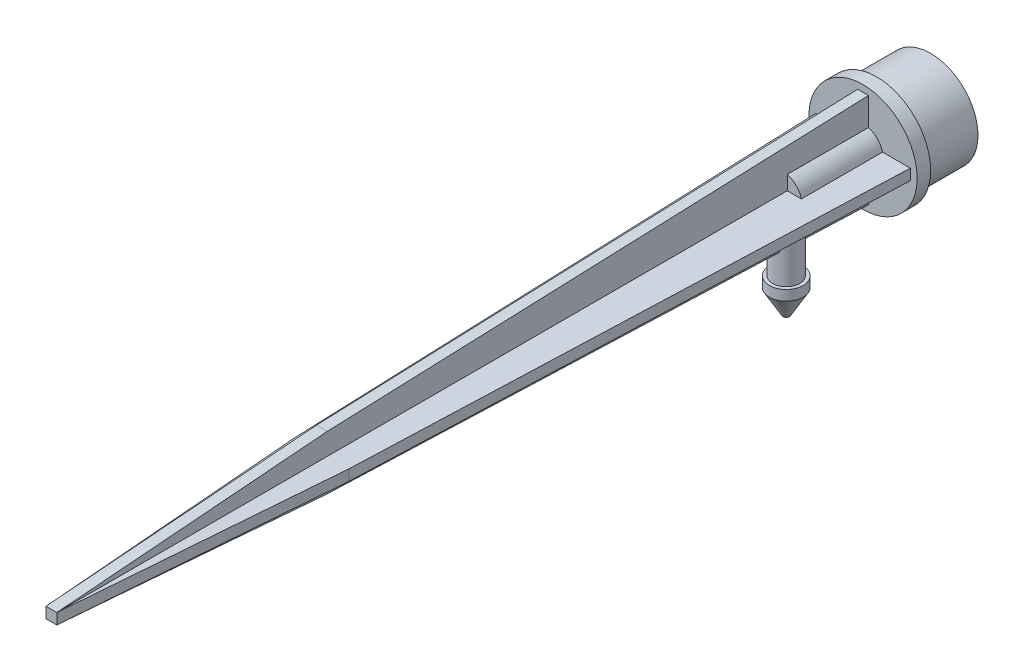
ISO-10303-21;
HEADER;
FILE_DESCRIPTION(('STEP AP214'),'2;1');
FILE_NAME('part.step','',(''),(''),'','','');
FILE_SCHEMA(('AUTOMOTIVE_DESIGN { 1 0 10303 214 1 1 1 1 }'));
ENDSEC;
DATA;
#1=APPLICATION_CONTEXT('core data for automotive mechanical design processes');
#2=APPLICATION_PROTOCOL_DEFINITION('international standard','automotive_design',2000,#1);
#3=PRODUCT_CONTEXT('',#1,'mechanical');
#4=PRODUCT('Part','Part','',(#3));
#5=PRODUCT_RELATED_PRODUCT_CATEGORY('part','',(#4));
#6=PRODUCT_DEFINITION_FORMATION('','',#4);
#7=PRODUCT_DEFINITION_CONTEXT('part definition',#1,'design');
#8=PRODUCT_DEFINITION('design','',#6,#7);
#9=PRODUCT_DEFINITION_SHAPE('','',#8);
#10=(LENGTH_UNIT() NAMED_UNIT(*) SI_UNIT(.MILLI.,.METRE.));
#11=(NAMED_UNIT(*) PLANE_ANGLE_UNIT() SI_UNIT($,.RADIAN.));
#12=(NAMED_UNIT(*) SI_UNIT($,.STERADIAN.) SOLID_ANGLE_UNIT());
#13=UNCERTAINTY_MEASURE_WITH_UNIT(LENGTH_MEASURE(1.E-05),#10,'distance_accuracy_value','');
#14=(GEOMETRIC_REPRESENTATION_CONTEXT(3) GLOBAL_UNCERTAINTY_ASSIGNED_CONTEXT((#13)) GLOBAL_UNIT_ASSIGNED_CONTEXT((#10,
#11,#12)) REPRESENTATION_CONTEXT('',''));
#15=CARTESIAN_POINT('',(0.,0.,0.));
#16=DIRECTION('',(0.,0.,1.));
#17=DIRECTION('',(1.,0.,0.));
#18=AXIS2_PLACEMENT_3D('',#15,#16,#17);
#19=CARTESIAN_POINT('',(0.,-15.8,21.3499663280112));
#20=DIRECTION('',(0.,1.,0.));
#21=DIRECTION('',(-1.,0.,0.));
#22=AXIS2_PLACEMENT_3D('',#19,#20,#21);
#23=CYLINDRICAL_SURFACE('',#22,2.);
#24=DIRECTION('',(0.,1.,0.));
#25=VECTOR('',#24,1.);
#26=CARTESIAN_POINT('',(-1.89141646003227,-15.8,22.));
#27=LINE('',#26,#25);
#28=CARTESIAN_POINT('',(-1.89141646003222,-2.32863560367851,22.));
#29=VERTEX_POINT('',#28);
#30=CARTESIAN_POINT('',(-1.89141646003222,-0.799999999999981,22.));
#31=VERTEX_POINT('',#30);
#32=EDGE_CURVE('E992',#29,#31,#27,.T.);
#33=ORIENTED_EDGE('',*,*,#32,.F.);
#34=CARTESIAN_POINT('',(-1.89141646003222,-2.32863560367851,22.));
#35=CARTESIAN_POINT('',(-1.90537733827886,-2.31729488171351,21.9593723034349));
#36=CARTESIAN_POINT('',(-1.91809765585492,-2.30675617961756,21.9181015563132));
#37=CARTESIAN_POINT('',(-1.94093647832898,-2.28757245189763,21.8343782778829));
#38=CARTESIAN_POINT('',(-1.95105270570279,-2.2789290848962,21.7919247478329));
#39=CARTESIAN_POINT('',(-1.97725007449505,-2.25633136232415,21.6632041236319));
#40=CARTESIAN_POINT('',(-1.98922933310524,-2.24566789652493,21.575434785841));
#41=CARTESIAN_POINT('',(-2.00140997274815,-2.23482292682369,21.397990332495));
#42=CARTESIAN_POINT('',(-2.00155171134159,-2.23469450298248,21.3083078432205));
#43=CARTESIAN_POINT('',(-1.98991562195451,-2.24505867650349,21.1304954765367));
#44=CARTESIAN_POINT('',(-1.97815403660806,-2.25553680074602,21.0423636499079));
#45=CARTESIAN_POINT('',(-1.94430460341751,-2.28476282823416,20.8737757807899));
#46=CARTESIAN_POINT('',(-1.92269481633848,-2.30312581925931,20.7931526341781));
#47=CARTESIAN_POINT('',(-1.8702624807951,-2.34590364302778,20.6365536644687));
#48=CARTESIAN_POINT('',(-1.83942212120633,-2.37033016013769,20.5605871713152));
#49=CARTESIAN_POINT('',(-1.75329505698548,-2.43516385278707,20.3804328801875));
#50=CARTESIAN_POINT('',(-1.69328331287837,-2.47776269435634,20.2792784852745));
#51=CARTESIAN_POINT('',(-1.55730957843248,-2.56541545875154,20.0896359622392));
#52=CARTESIAN_POINT('',(-1.48133823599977,-2.61047080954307,20.0011553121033));
#53=CARTESIAN_POINT('',(-1.31281849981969,-2.69920813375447,19.83648950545));
#54=CARTESIAN_POINT('',(-1.21997787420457,-2.74284668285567,19.7605752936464));
#55=CARTESIAN_POINT('',(-1.07017788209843,-2.80314723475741,19.6592967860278));
#56=CARTESIAN_POINT('',(-1.01844132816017,-2.82240152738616,19.6276153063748));
#57=CARTESIAN_POINT('',(-0.911646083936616,-2.85868662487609,19.5687816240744));
#58=CARTESIAN_POINT('',(-0.856584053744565,-2.87571513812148,19.5416340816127));
#59=CARTESIAN_POINT('',(-0.800000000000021,-2.89136645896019,19.5169360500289));
#60=B_SPLINE_CURVE_WITH_KNOTS('',3,(#34,#35,#36,#37,#38,#39,#40,#41,#42,#43,#44,#45,#46,#47,#48,
#49,#50,#51,#52,#53,#54,#55,#56,#57,#58,#59),.UNSPECIFIED.,.F.,.F.,(4,2,2,2,2,2,2,2,2,2,2,2,4),
(0.,0.133242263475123,0.26660066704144,0.532854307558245,0.800449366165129,1.06767977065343,
1.32313005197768,1.57907645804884,1.95239296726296,2.32592884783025,2.70669021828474,
2.89738359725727,3.0882717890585),.UNSPECIFIED.);
#61=CARTESIAN_POINT('',(-0.80000000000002,-2.89136645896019,19.5169360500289));
#62=VERTEX_POINT('',#61);
#63=EDGE_CURVE('E232',#29,#62,#60,.T.);
#64=ORIENTED_EDGE('',*,*,#63,.T.);
#65=DIRECTION('',(0.,1.,0.));
#66=VECTOR('',#65,1.);
#67=CARTESIAN_POINT('',(-0.800000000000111,-15.8,19.5169360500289));
#68=LINE('',#67,#66);
#69=CARTESIAN_POINT('',(-0.8,-6.64311489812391,19.5169360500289));
#70=VERTEX_POINT('',#69);
#71=EDGE_CURVE('E1015',#62,#70,#68,.F.);
#72=ORIENTED_EDGE('',*,*,#71,.T.);
#73=CARTESIAN_POINT('',(0.,-6.57437626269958,21.3499663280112));
#74=DIRECTION('',(0.,0.999297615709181,-0.0374736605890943));
#75=DIRECTION('',(0.,0.0374736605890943,0.999297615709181));
#76=AXIS2_PLACEMENT_3D('',#73,#74,#75);
#77=ELLIPSE('',#76,2.00140575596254,2.);
#78=CARTESIAN_POINT('',(0.799999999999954,-6.64311489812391,19.5169360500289));
#79=VERTEX_POINT('',#78);
#80=EDGE_CURVE('E409',#70,#79,#77,.F.);
#81=ORIENTED_EDGE('',*,*,#80,.T.);
#82=DIRECTION('',(0.,1.,0.));
#83=VECTOR('',#82,1.);
#84=CARTESIAN_POINT('',(0.79999999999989,-15.8,19.5169360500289));
#85=LINE('',#84,#83);
#86=CARTESIAN_POINT('',(0.79999999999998,-2.8913664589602,19.5169360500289));
#87=VERTEX_POINT('',#86);
#88=EDGE_CURVE('E402',#79,#87,#85,.T.);
#89=ORIENTED_EDGE('',*,*,#88,.T.);
#90=CARTESIAN_POINT('',(-2.00000000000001,-2.23606797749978,21.3499663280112));
#91=CARTESIAN_POINT('',(-1.99999453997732,-2.23607753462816,21.2523380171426));
#92=CARTESIAN_POINT('',(-1.99278992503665,-2.24258071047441,21.1546755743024));
#93=CARTESIAN_POINT('',(-1.96458268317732,-2.26731972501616,20.9628464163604));
#94=CARTESIAN_POINT('',(-1.94355530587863,-2.2855766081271,20.8686862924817));
#95=CARTESIAN_POINT('',(-1.88935861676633,-2.33056585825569,20.6872308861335));
#96=CARTESIAN_POINT('',(-1.85630718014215,-2.35721561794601,20.5998786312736));
#97=CARTESIAN_POINT('',(-1.77934008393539,-2.41584094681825,20.4321004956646));
#98=CARTESIAN_POINT('',(-1.73542216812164,-2.4478176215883,20.3516760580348));
#99=CARTESIAN_POINT('',(-1.63002410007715,-2.51946072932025,20.1863194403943));
#100=CARTESIAN_POINT('',(-1.56687435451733,-2.55954936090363,20.102634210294));
#101=CARTESIAN_POINT('',(-1.42819219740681,-2.63944827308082,19.9459636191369));
#102=CARTESIAN_POINT('',(-1.35264773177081,-2.67925824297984,19.8729888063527));
#103=CARTESIAN_POINT('',(-1.17815690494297,-2.76088818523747,19.7293226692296));
#104=CARTESIAN_POINT('',(-1.0774064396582,-2.80216785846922,19.6604838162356));
#105=CARTESIAN_POINT('',(-0.862470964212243,-2.87558484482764,19.5413242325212));
#106=CARTESIAN_POINT('',(-0.748301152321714,-2.90773236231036,19.49098281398));
#107=CARTESIAN_POINT('',(-0.523249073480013,-2.95599907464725,19.4164099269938));
#108=CARTESIAN_POINT('',(-0.413434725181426,-2.97351175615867,19.3898829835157));
#109=CARTESIAN_POINT('',(-0.189695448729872,-2.99609745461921,19.3557818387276));
#110=CARTESIAN_POINT('',(-0.0757758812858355,-3.00118613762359,19.3481837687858));
#111=CARTESIAN_POINT('',(0.134147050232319,-2.99855361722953,19.3521387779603));
#112=CARTESIAN_POINT('',(0.230240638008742,-2.99266264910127,19.3609553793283));
#113=CARTESIAN_POINT('',(0.419238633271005,-2.9720818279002,19.3920573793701));
#114=CARTESIAN_POINT('',(0.512142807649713,-2.95739133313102,19.4143437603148));
#115=CARTESIAN_POINT('',(0.692077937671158,-2.92052091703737,19.4711620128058));
#116=CARTESIAN_POINT('',(0.779130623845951,-2.89837077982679,19.5056452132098));
#117=CARTESIAN_POINT('',(0.946209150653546,-2.84821104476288,19.585519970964));
#118=CARTESIAN_POINT('',(1.02623370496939,-2.82020037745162,19.6309135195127));
#119=CARTESIAN_POINT('',(1.18828429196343,-2.75618058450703,19.7379450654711));
#120=CARTESIAN_POINT('',(1.26919148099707,-2.71960408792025,19.800933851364));
#121=CARTESIAN_POINT('',(1.41998807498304,-2.64400601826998,19.9378650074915));
#122=CARTESIAN_POINT('',(1.48986013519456,-2.60498072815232,20.011824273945));
#123=CARTESIAN_POINT('',(1.62772235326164,-2.52150044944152,20.1819295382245));
#124=CARTESIAN_POINT('',(1.69373593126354,-2.47714320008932,20.2797374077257));
#125=CARTESIAN_POINT('',(1.80834874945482,-2.39475610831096,20.4874761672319));
#126=CARTESIAN_POINT('',(1.85697718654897,-2.3567157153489,20.5973863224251));
#127=CARTESIAN_POINT('',(1.92332724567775,-2.3026287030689,20.7946853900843));
#128=CARTESIAN_POINT('',(1.94590791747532,-2.28340364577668,20.8795596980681));
#129=CARTESIAN_POINT('',(1.97979555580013,-2.25409039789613,21.0530058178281));
#130=CARTESIAN_POINT('',(1.99112206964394,-2.24398636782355,21.1415709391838));
#131=CARTESIAN_POINT('',(2.00179400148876,-2.23447556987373,21.3204093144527));
#132=CARTESIAN_POINT('',(2.00108729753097,-2.2351153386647,21.4106883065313));
#133=CARTESIAN_POINT('',(1.98761629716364,-2.24709880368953,21.5896501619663));
#134=CARTESIAN_POINT('',(1.9748422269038,-2.25845117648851,21.6783316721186));
#135=CARTESIAN_POINT('',(1.93899811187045,-2.28927977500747,21.8473557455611));
#136=CARTESIAN_POINT('',(1.91646174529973,-2.3083318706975,21.9278940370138));
#137=CARTESIAN_POINT('',(1.86223041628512,-2.35229958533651,22.0840925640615));
#138=CARTESIAN_POINT('',(1.83053237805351,-2.37721717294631,22.1597511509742));
#139=CARTESIAN_POINT('',(1.75163346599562,-2.43611483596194,22.3201683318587));
#140=CARTESIAN_POINT('',(1.70260028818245,-2.47091081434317,22.4037231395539));
#141=CARTESIAN_POINT('',(1.59352731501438,-2.54262514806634,22.5623831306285));
#142=CARTESIAN_POINT('',(1.53347411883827,-2.57954604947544,22.6374778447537));
#143=CARTESIAN_POINT('',(1.38876657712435,-2.66075678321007,22.7939286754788));
#144=CARTESIAN_POINT('',(1.30160386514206,-2.70489452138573,22.8730691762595));
#145=CARTESIAN_POINT('',(1.11309948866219,-2.78775581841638,23.0157830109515));
#146=CARTESIAN_POINT('',(1.011770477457,-2.82648414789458,23.079370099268));
#147=CARTESIAN_POINT('',(0.817487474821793,-2.88790821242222,23.1778580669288));
#148=CARTESIAN_POINT('',(0.726662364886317,-2.91225458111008,23.2159228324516));
#149=CARTESIAN_POINT('',(0.538757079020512,-2.95278707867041,23.2785735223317));
#150=CARTESIAN_POINT('',(0.441682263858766,-2.96898009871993,23.303170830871));
#151=CARTESIAN_POINT('',(0.24336939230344,-2.99178364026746,23.33766329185));
#152=CARTESIAN_POINT('',(0.142114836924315,-2.99835150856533,23.3474930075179));
#153=CARTESIAN_POINT('',(-0.0608555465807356,-3.00109821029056,23.3516141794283));
#154=CARTESIAN_POINT('',(-0.162571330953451,-2.99727800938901,23.3459070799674));
#155=CARTESIAN_POINT('',(-0.355757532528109,-2.98029555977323,23.3203068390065));
#156=CARTESIAN_POINT('',(-0.447435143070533,-2.96783277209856,23.3014753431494));
#157=CARTESIAN_POINT('',(-0.626018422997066,-2.93536106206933,23.2517283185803));
#158=CARTESIAN_POINT('',(-0.712923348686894,-2.91535096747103,23.220810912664));
#159=CARTESIAN_POINT('',(-0.885147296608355,-2.86791765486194,23.1460276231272));
#160=CARTESIAN_POINT('',(-0.970083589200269,-2.84013248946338,23.1015160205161));
#161=CARTESIAN_POINT('',(-1.13155266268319,-2.77975408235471,23.0018156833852));
#162=CARTESIAN_POINT('',(-1.20808037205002,-2.74715796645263,22.9466205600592));
#163=CARTESIAN_POINT('',(-1.36329422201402,-2.67392931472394,22.8173374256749));
#164=CARTESIAN_POINT('',(-1.44042679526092,-2.6328391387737,22.7416433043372));
#165=CARTESIAN_POINT('',(-1.58160022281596,-2.55053357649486,22.5788527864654));
#166=CARTESIAN_POINT('',(-1.64563128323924,-2.50931811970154,22.4917479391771));
#167=CARTESIAN_POINT('',(-1.75513253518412,-2.43384213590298,22.3140987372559));
#168=CARTESIAN_POINT('',(-1.80164646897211,-2.39929086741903,22.2243245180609));
#169=CARTESIAN_POINT('',(-1.88115802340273,-2.33747501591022,22.0366818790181));
#170=CARTESIAN_POINT('',(-1.91418190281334,-2.31019631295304,21.9388296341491));
#171=CARTESIAN_POINT('',(-1.95936262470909,-2.27191051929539,21.7591948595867));
#172=CARTESIAN_POINT('',(-1.97452228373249,-2.25863695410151,21.6786580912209));
#173=CARTESIAN_POINT('',(-1.99483915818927,-2.24071519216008,21.5154099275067));
#174=CARTESIAN_POINT('',(-2.00000462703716,-2.23605987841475,21.4327003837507));
#175=CARTESIAN_POINT('',(-2.00000000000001,-2.23606797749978,21.3499663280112));
#176=B_SPLINE_CURVE_WITH_KNOTS('',3,(#90,#91,#92,#93,#94,#95,#96,#97,#98,#99,#100,#101,#102,
#103,#104,#105,#106,#107,#108,#109,#110,#111,#112,#113,#114,#115,#116,#117,#118,#119,#120,#121,
#122,#123,#124,#125,#126,#127,#128,#129,#130,#131,#132,#133,#134,#135,#136,#137,#138,#139,#140,
#141,#142,#143,#144,#145,#146,#147,#148,#149,#150,#151,#152,#153,#154,#155,#156,#157,#158,#159,
#160,#161,#162,#163,#164,#165,#166,#167,#168,#169,#170,#171,#172,#173,#174,#175),.UNSPECIFIED.,
.T.,.F.,(4,2,2,2,2,2,2,2,2,2,2,2,2,2,2,2,2,2,2,2,2,2,2,2,2,2,2,2,2,2,2,2,2,2,2,2,2,2,2,2,2,2,4),
(0.,0.292506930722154,0.585539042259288,0.875772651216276,1.16606657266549,1.50154677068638,
1.83735518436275,2.22167031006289,2.6055542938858,2.9463748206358,3.28676536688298,
3.57539534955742,3.86404638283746,4.15155831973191,4.43912276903,4.76447525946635,
5.09033414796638,5.46678703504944,5.84260469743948,6.11126090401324,6.37944966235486,
6.64880037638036,6.91836943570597,7.17476451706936,7.43124577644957,7.73899230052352,
8.04711556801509,8.42254684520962,8.7976449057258,9.10070580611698,9.40351012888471,
9.70765229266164,10.0117661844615,10.2937678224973,10.5758132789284,10.874178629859,
11.1727229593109,11.5182220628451,11.863978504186,12.1833412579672,12.5020793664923,
12.7501661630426,12.9980479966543),.UNSPECIFIED.);
#177=CARTESIAN_POINT('',(1.89141646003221,-2.32863560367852,22.));
#178=VERTEX_POINT('',#177);
#179=EDGE_CURVE('E710',#87,#178,#176,.T.);
#180=ORIENTED_EDGE('',*,*,#179,.T.);
#181=DIRECTION('',(0.,1.,0.));
#182=VECTOR('',#181,1.);
#183=CARTESIAN_POINT('',(1.89141646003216,-15.8,22.));
#184=LINE('',#183,#182);
#185=CARTESIAN_POINT('',(1.89141646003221,-0.800000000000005,22.));
#186=VERTEX_POINT('',#185);
#187=EDGE_CURVE('E240',#186,#178,#184,.F.);
#188=ORIENTED_EDGE('',*,*,#187,.F.);
#189=CARTESIAN_POINT('',(0.,-0.8,21.3499663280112));
#190=DIRECTION('',(0.,-1.,0.));
#191=DIRECTION('',(1.,0.,0.));
#192=AXIS2_PLACEMENT_3D('',#189,#190,#191);
#193=CIRCLE('',#192,2.);
#194=CARTESIAN_POINT('',(0.799999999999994,-0.800000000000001,23.1829966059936));
#195=VERTEX_POINT('',#194);
#196=EDGE_CURVE('E989',#186,#195,#193,.T.);
#197=ORIENTED_EDGE('',*,*,#196,.T.);
#198=DIRECTION('',(0.,1.,0.));
#199=VECTOR('',#198,1.);
#200=CARTESIAN_POINT('',(0.79999999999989,-15.8,23.1829966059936));
#201=LINE('',#200,#199);
#202=CARTESIAN_POINT('',(0.799999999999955,-6.50563762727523,23.1829966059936));
#203=VERTEX_POINT('',#202);
#204=EDGE_CURVE('E403',#195,#203,#201,.F.);
#205=ORIENTED_EDGE('',*,*,#204,.T.);
#206=CARTESIAN_POINT('',(-0.8,-6.50563762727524,23.1829966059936));
#207=VERTEX_POINT('',#206);
#208=EDGE_CURVE('E384',#203,#207,#77,.F.);
#209=ORIENTED_EDGE('',*,*,#208,.T.);
#210=DIRECTION('',(0.,1.,0.));
#211=VECTOR('',#210,1.);
#212=CARTESIAN_POINT('',(-0.800000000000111,-15.8,23.1829966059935));
#213=LINE('',#212,#211);
#214=CARTESIAN_POINT('',(-0.800000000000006,-0.799999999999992,23.1829966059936));
#215=VERTEX_POINT('',#214);
#216=EDGE_CURVE('E396',#207,#215,#213,.T.);
#217=ORIENTED_EDGE('',*,*,#216,.T.);
#218=EDGE_CURVE('E1008',#215,#31,#193,.T.);
#219=ORIENTED_EDGE('',*,*,#218,.T.);
#220=EDGE_LOOP('',(#33,#64,#72,#81,#89,#180,#188,#197,#205,#209,#217,#219));
#221=FACE_BOUND('',#220,.T.);
#222=CARTESIAN_POINT('',(0.,-10.8,21.3499663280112));
#223=DIRECTION('',(0.,-1.,0.));
#224=DIRECTION('',(1.,0.,0.));
#225=AXIS2_PLACEMENT_3D('',#222,#223,#224);
#226=CIRCLE('',#225,2.);
#227=CARTESIAN_POINT('',(1.99999999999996,-10.8,21.3499663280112));
#228=VERTEX_POINT('',#227);
#229=EDGE_CURVE('E413',#228,#228,#226,.T.);
#230=ORIENTED_EDGE('',*,*,#229,.F.);
#231=EDGE_LOOP('',(#230));
#232=FACE_BOUND('',#231,.T.);
#233=ADVANCED_FACE('F31',(#221,#232),#23,.T.);
#234=CARTESIAN_POINT('',(0.,0.,22.));
#235=DIRECTION('',(0.,0.,-1.));
#236=DIRECTION('',(-1.,0.,0.));
#237=AXIS2_PLACEMENT_3D('',#234,#235,#236);
#238=CYLINDRICAL_SURFACE('',#237,3.);
#239=ORIENTED_EDGE('',*,*,#63,.F.);
#240=CARTESIAN_POINT('',(0.,0.,22.));
#241=DIRECTION('',(0.,0.,1.));
#242=DIRECTION('',(1.,0.,0.));
#243=AXIS2_PLACEMENT_3D('',#240,#241,#242);
#244=CIRCLE('',#243,3.);
#245=CARTESIAN_POINT('',(-2.8913664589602,-0.79999999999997,22.));
#246=VERTEX_POINT('',#245);
#247=EDGE_CURVE('E1036',#246,#29,#244,.T.);
#248=ORIENTED_EDGE('',*,*,#247,.F.);
#249=DIRECTION('',(0.,0.,-1.));
#250=VECTOR('',#249,1.);
#251=CARTESIAN_POINT('',(-2.8913664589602,-0.79999999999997,22.));
#252=LINE('',#251,#250);
#253=CARTESIAN_POINT('',(-2.8913664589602,-0.79999999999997,10.));
#254=VERTEX_POINT('',#253);
#255=EDGE_CURVE('E824',#254,#246,#252,.F.);
#256=ORIENTED_EDGE('',*,*,#255,.F.);
#257=CARTESIAN_POINT('',(0.,0.,10.));
#258=DIRECTION('',(0.,0.,1.));
#259=DIRECTION('',(1.,0.,0.));
#260=AXIS2_PLACEMENT_3D('',#257,#258,#259);
#261=CIRCLE('',#260,3.);
#262=CARTESIAN_POINT('',(-0.80000000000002,-2.89136645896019,10.));
#263=VERTEX_POINT('',#262);
#264=EDGE_CURVE('E975',#254,#263,#261,.T.);
#265=ORIENTED_EDGE('',*,*,#264,.T.);
#266=DIRECTION('',(0.,0.,-1.));
#267=VECTOR('',#266,1.);
#268=CARTESIAN_POINT('',(-0.80000000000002,-2.89136645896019,22.));
#269=LINE('',#268,#267);
#270=EDGE_CURVE('E822',#62,#263,#269,.T.);
#271=ORIENTED_EDGE('',*,*,#270,.F.);
#272=EDGE_LOOP('',(#239,#248,#256,#265,#271));
#273=FACE_BOUND('',#272,.T.);
#274=ADVANCED_FACE('F705',(#273),#238,.T.);
#275=ORIENTED_EDGE('',*,*,#179,.F.);
#276=DIRECTION('',(0.,0.,-1.));
#277=VECTOR('',#276,1.);
#278=CARTESIAN_POINT('',(0.79999999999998,-2.8913664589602,22.));
#279=LINE('',#278,#277);
#280=CARTESIAN_POINT('',(0.79999999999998,-2.8913664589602,10.));
#281=VERTEX_POINT('',#280);
#282=EDGE_CURVE('E819',#281,#87,#279,.F.);
#283=ORIENTED_EDGE('',*,*,#282,.F.);
#284=CARTESIAN_POINT('',(2.89136645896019,-0.80000000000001,10.));
#285=VERTEX_POINT('',#284);
#286=EDGE_CURVE('E831',#281,#285,#261,.T.);
#287=ORIENTED_EDGE('',*,*,#286,.T.);
#288=DIRECTION('',(0.,0.,-1.));
#289=VECTOR('',#288,1.);
#290=CARTESIAN_POINT('',(2.89136645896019,-0.80000000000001,22.));
#291=LINE('',#290,#289);
#292=CARTESIAN_POINT('',(2.89136645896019,-0.80000000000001,22.));
#293=VERTEX_POINT('',#292);
#294=EDGE_CURVE('E817',#293,#285,#291,.T.);
#295=ORIENTED_EDGE('',*,*,#294,.F.);
#296=EDGE_CURVE('E837',#178,#293,#244,.T.);
#297=ORIENTED_EDGE('',*,*,#296,.F.);
#298=EDGE_LOOP('',(#275,#283,#287,#295,#297));
#299=FACE_BOUND('',#298,.T.);
#300=ADVANCED_FACE('F984',(#299),#238,.T.);
#301=CARTESIAN_POINT('',(0.,0.,22.));
#302=DIRECTION('',(0.,0.,1.));
#303=DIRECTION('',(1.,0.,0.));
#304=AXIS2_PLACEMENT_3D('',#301,#302,#303);
#305=PLANE('',#304);
#306=ORIENTED_EDGE('',*,*,#247,.T.);
#307=ORIENTED_EDGE('',*,*,#32,.T.);
#308=DIRECTION('',(-1.,0.,0.));
#309=VECTOR('',#308,1.);
#310=CARTESIAN_POINT('',(0.,-0.8,22.));
#311=LINE('',#310,#309);
#312=EDGE_CURVE('E867',#31,#246,#311,.T.);
#313=ORIENTED_EDGE('',*,*,#312,.T.);
#314=EDGE_LOOP('',(#306,#307,#313));
#315=FACE_BOUND('',#314,.T.);
#316=ADVANCED_FACE('F1023',(#315),#305,.T.);
#317=DIRECTION('',(-1.,0.,0.));
#318=VECTOR('',#317,1.);
#319=CARTESIAN_POINT('',(0.,-0.8,22.));
#320=LINE('',#319,#318);
#321=EDGE_CURVE('E865',#293,#186,#320,.T.);
#322=ORIENTED_EDGE('',*,*,#321,.T.);
#323=ORIENTED_EDGE('',*,*,#187,.T.);
#324=ORIENTED_EDGE('',*,*,#296,.T.);
#325=EDGE_LOOP('',(#322,#323,#324));
#326=FACE_BOUND('',#325,.T.);
#327=ADVANCED_FACE('F789',(#326),#305,.T.);
#328=CARTESIAN_POINT('',(-0.800000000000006,-0.799999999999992,130.));
#329=DIRECTION('',(0.,1.,0.));
#330=DIRECTION('',(-1.,0.,0.));
#331=AXIS2_PLACEMENT_3D('',#328,#329,#330);
#332=PLANE('',#331);
#333=ORIENTED_EDGE('',*,*,#218,.F.);
#334=DIRECTION('',(0.,0.,-1.));
#335=VECTOR('',#334,1.);
#336=CARTESIAN_POINT('',(-0.800000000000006,-0.799999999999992,130.));
#337=LINE('',#336,#335);
#338=CARTESIAN_POINT('',(-0.8,-0.799999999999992,130.));
#339=VERTEX_POINT('',#338);
#340=EDGE_CURVE('E399',#339,#215,#337,.T.);
#341=ORIENTED_EDGE('',*,*,#340,.F.);
#342=DIRECTION('',(-0.0797452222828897,0.,-0.996815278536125));
#343=VECTOR('',#342,1.);
#344=CARTESIAN_POINT('',(-0.800000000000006,-0.799999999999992,130.));
#345=LINE('',#344,#343);
#346=CARTESIAN_POINT('',(-4.,-0.799999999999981,90.));
#347=VERTEX_POINT('',#346);
#348=EDGE_CURVE('E883',#339,#347,#345,.T.);
#349=ORIENTED_EDGE('',*,*,#348,.T.);
#350=DIRECTION('',(-0.0374736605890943,0.,-0.999297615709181));
#351=VECTOR('',#350,1.);
#352=CARTESIAN_POINT('',(-2.49761273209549,-0.799999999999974,130.063660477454));
#353=LINE('',#352,#351);
#354=CARTESIAN_POINT('',(-7.,-0.799999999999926,10.));
#355=VERTEX_POINT('',#354);
#356=EDGE_CURVE('E1006',#347,#355,#353,.T.);
#357=ORIENTED_EDGE('',*,*,#356,.T.);
#358=DIRECTION('',(1.,0.,0.));
#359=VECTOR('',#358,1.);
#360=CARTESIAN_POINT('',(-0.800000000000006,-0.799999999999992,10.));
#361=LINE('',#360,#359);
#362=EDGE_CURVE('E931',#355,#254,#361,.T.);
#363=ORIENTED_EDGE('',*,*,#362,.T.);
#364=ORIENTED_EDGE('',*,*,#255,.T.);
#365=ORIENTED_EDGE('',*,*,#312,.F.);
#366=EDGE_LOOP('',(#333,#341,#349,#357,#363,#364,#365));
#367=FACE_BOUND('',#366,.T.);
#368=ADVANCED_FACE('F785',(#367),#332,.F.);
#369=CARTESIAN_POINT('',(-0.800000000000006,-0.799999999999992,130.));
#370=DIRECTION('',(1.,0.,0.));
#371=DIRECTION('',(0.,1.,0.));
#372=AXIS2_PLACEMENT_3D('',#369,#370,#371);
#373=PLANE('',#372);
#374=ORIENTED_EDGE('',*,*,#71,.F.);
#375=ORIENTED_EDGE('',*,*,#270,.T.);
#376=DIRECTION('',(0.,-1.,0.));
#377=VECTOR('',#376,1.);
#378=CARTESIAN_POINT('',(-0.800000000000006,-0.799999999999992,10.));
#379=LINE('',#378,#377);
#380=CARTESIAN_POINT('',(-0.8,-6.99999999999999,10.));
#381=VERTEX_POINT('',#380);
#382=EDGE_CURVE('E933',#263,#381,#379,.T.);
#383=ORIENTED_EDGE('',*,*,#382,.T.);
#384=DIRECTION('',(0.,-0.0374736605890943,-0.999297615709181));
#385=VECTOR('',#384,1.);
#386=CARTESIAN_POINT('',(-0.8,-3.99999999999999,90.));
#387=LINE('',#386,#385);
#388=EDGE_CURVE('E392',#70,#381,#387,.T.);
#389=ORIENTED_EDGE('',*,*,#388,.F.);
#390=EDGE_LOOP('',(#374,#375,#383,#389));
#391=FACE_BOUND('',#390,.T.);
#392=ADVANCED_FACE('F782',(#391),#373,.F.);
#393=ORIENTED_EDGE('',*,*,#216,.F.);
#394=CARTESIAN_POINT('',(-0.8,-3.99999999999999,90.));
#395=VERTEX_POINT('',#394);
#396=EDGE_CURVE('E380',#395,#207,#387,.T.);
#397=ORIENTED_EDGE('',*,*,#396,.F.);
#398=DIRECTION('',(0.,-0.07974522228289,-0.996815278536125));
#399=VECTOR('',#398,1.);
#400=CARTESIAN_POINT('',(-0.8,-0.799999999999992,130.));
#401=LINE('',#400,#399);
#402=EDGE_CURVE('E391',#339,#395,#401,.T.);
#403=ORIENTED_EDGE('',*,*,#402,.F.);
#404=ORIENTED_EDGE('',*,*,#340,.T.);
#405=EDGE_LOOP('',(#393,#397,#403,#404));
#406=FACE_BOUND('',#405,.T.);
#407=ADVANCED_FACE('F397',(#406),#373,.F.);
#408=CARTESIAN_POINT('',(0.799999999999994,-0.800000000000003,130.));
#409=DIRECTION('',(-1.,0.,0.));
#410=DIRECTION('',(0.,-1.,0.));
#411=AXIS2_PLACEMENT_3D('',#408,#409,#410);
#412=PLANE('',#411);
#413=ORIENTED_EDGE('',*,*,#204,.F.);
#414=DIRECTION('',(0.,0.,-1.));
#415=VECTOR('',#414,1.);
#416=CARTESIAN_POINT('',(0.799999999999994,-0.800000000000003,130.));
#417=LINE('',#416,#415);
#418=CARTESIAN_POINT('',(0.799999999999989,-0.800000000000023,130.));
#419=VERTEX_POINT('',#418);
#420=EDGE_CURVE('E812',#419,#195,#417,.T.);
#421=ORIENTED_EDGE('',*,*,#420,.F.);
#422=DIRECTION('',(0.,-0.0797452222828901,-0.996815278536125));
#423=VECTOR('',#422,1.);
#424=CARTESIAN_POINT('',(0.799999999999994,-0.799999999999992,130.));
#425=LINE('',#424,#423);
#426=CARTESIAN_POINT('',(0.799999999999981,-3.99999999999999,90.));
#427=VERTEX_POINT('',#426);
#428=EDGE_CURVE('E910',#419,#427,#425,.T.);
#429=ORIENTED_EDGE('',*,*,#428,.T.);
#430=DIRECTION('',(0.,-0.0374736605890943,-0.999297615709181));
#431=VECTOR('',#430,1.);
#432=CARTESIAN_POINT('',(0.799999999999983,-2.49761273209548,130.063660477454));
#433=LINE('',#432,#431);
#434=EDGE_CURVE('E913',#427,#203,#433,.T.);
#435=ORIENTED_EDGE('',*,*,#434,.T.);
#436=EDGE_LOOP('',(#413,#421,#429,#435));
#437=FACE_BOUND('',#436,.T.);
#438=ADVANCED_FACE('F778',(#437),#412,.F.);
#439=ORIENTED_EDGE('',*,*,#88,.F.);
#440=CARTESIAN_POINT('',(0.799999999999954,-6.99999999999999,10.));
#441=VERTEX_POINT('',#440);
#442=EDGE_CURVE('E911',#79,#441,#433,.T.);
#443=ORIENTED_EDGE('',*,*,#442,.T.);
#444=DIRECTION('',(0.,1.,0.));
#445=VECTOR('',#444,1.);
#446=CARTESIAN_POINT('',(0.799999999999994,-0.800000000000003,10.));
#447=LINE('',#446,#445);
#448=EDGE_CURVE('E939',#441,#281,#447,.T.);
#449=ORIENTED_EDGE('',*,*,#448,.T.);
#450=ORIENTED_EDGE('',*,*,#282,.T.);
#451=EDGE_LOOP('',(#439,#443,#449,#450));
#452=FACE_BOUND('',#451,.T.);
#453=ADVANCED_FACE('F776',(#452),#412,.F.);
#454=CARTESIAN_POINT('',(0.799999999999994,-0.800000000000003,130.));
#455=DIRECTION('',(0.,1.,0.));
#456=DIRECTION('',(-1.,0.,0.));
#457=AXIS2_PLACEMENT_3D('',#454,#455,#456);
#458=PLANE('',#457);
#459=ORIENTED_EDGE('',*,*,#196,.F.);
#460=ORIENTED_EDGE('',*,*,#321,.F.);
#461=ORIENTED_EDGE('',*,*,#294,.T.);
#462=DIRECTION('',(1.,0.,0.));
#463=VECTOR('',#462,1.);
#464=CARTESIAN_POINT('',(0.799999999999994,-0.800000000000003,10.));
#465=LINE('',#464,#463);
#466=CARTESIAN_POINT('',(7.,-0.800000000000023,10.));
#467=VERTEX_POINT('',#466);
#468=EDGE_CURVE('E941',#285,#467,#465,.T.);
#469=ORIENTED_EDGE('',*,*,#468,.T.);
#470=DIRECTION('',(-0.0374736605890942,0.,0.999297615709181));
#471=VECTOR('',#470,1.);
#472=CARTESIAN_POINT('',(2.4976127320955,-0.800000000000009,130.063660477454));
#473=LINE('',#472,#471);
#474=CARTESIAN_POINT('',(4.00000000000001,-0.800000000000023,90.));
#475=VERTEX_POINT('',#474);
#476=EDGE_CURVE('E888',#467,#475,#473,.T.);
#477=ORIENTED_EDGE('',*,*,#476,.T.);
#478=DIRECTION('',(-0.0797452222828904,0.,0.996815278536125));
#479=VECTOR('',#478,1.);
#480=CARTESIAN_POINT('',(0.79999999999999,-0.800000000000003,130.));
#481=LINE('',#480,#479);
#482=EDGE_CURVE('E899',#475,#419,#481,.T.);
#483=ORIENTED_EDGE('',*,*,#482,.T.);
#484=ORIENTED_EDGE('',*,*,#420,.T.);
#485=EDGE_LOOP('',(#459,#460,#461,#469,#477,#483,#484));
#486=FACE_BOUND('',#485,.T.);
#487=ADVANCED_FACE('F752',(#486),#458,.F.);
#488=CARTESIAN_POINT('',(99.2,-3.99999999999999,90.));
#489=DIRECTION('',(0.,0.999297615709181,-0.0374736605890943));
#490=DIRECTION('',(0.,0.0374736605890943,0.999297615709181));
#491=AXIS2_PLACEMENT_3D('',#488,#489,#490);
#492=PLANE('',#491);
#493=ORIENTED_EDGE('',*,*,#80,.F.);
#494=ORIENTED_EDGE('',*,*,#388,.T.);
#495=DIRECTION('',(1.,0.,0.));
#496=VECTOR('',#495,1.);
#497=CARTESIAN_POINT('',(-0.800000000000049,-6.99999999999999,10.));
#498=LINE('',#497,#496);
#499=EDGE_CURVE('E936',#381,#441,#498,.T.);
#500=ORIENTED_EDGE('',*,*,#499,.T.);
#501=ORIENTED_EDGE('',*,*,#442,.F.);
#502=EDGE_LOOP('',(#493,#494,#500,#501));
#503=FACE_BOUND('',#502,.T.);
#504=ADVANCED_FACE('F749',(#503),#492,.F.);
#505=ORIENTED_EDGE('',*,*,#208,.F.);
#506=ORIENTED_EDGE('',*,*,#434,.F.);
#507=DIRECTION('',(-1.,0.,0.));
#508=VECTOR('',#507,1.);
#509=CARTESIAN_POINT('',(99.2,-3.99999999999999,90.));
#510=LINE('',#509,#508);
#511=EDGE_CURVE('E387',#427,#395,#510,.T.);
#512=ORIENTED_EDGE('',*,*,#511,.T.);
#513=ORIENTED_EDGE('',*,*,#396,.T.);
#514=EDGE_LOOP('',(#505,#506,#512,#513));
#515=FACE_BOUND('',#514,.T.);
#516=ADVANCED_FACE('F382',(#515),#492,.F.);
#517=CARTESIAN_POINT('',(0.,0.,10.));
#518=DIRECTION('',(0.,0.,1.));
#519=DIRECTION('',(1.,0.,0.));
#520=AXIS2_PLACEMENT_3D('',#517,#518,#519);
#521=PLANE('',#520);
#522=DIRECTION('',(0.,1.,0.));
#523=VECTOR('',#522,1.);
#524=CARTESIAN_POINT('',(7.,-0.800000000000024,10.));
#525=LINE('',#524,#523);
#526=CARTESIAN_POINT('',(7.,0.799999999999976,10.));
#527=VERTEX_POINT('',#526);
#528=EDGE_CURVE('E943',#467,#527,#525,.T.);
#529=ORIENTED_EDGE('',*,*,#528,.F.);
#530=ORIENTED_EDGE('',*,*,#468,.F.);
#531=ORIENTED_EDGE('',*,*,#286,.F.);
#532=ORIENTED_EDGE('',*,*,#448,.F.);
#533=ORIENTED_EDGE('',*,*,#499,.F.);
#534=ORIENTED_EDGE('',*,*,#382,.F.);
#535=ORIENTED_EDGE('',*,*,#264,.F.);
#536=ORIENTED_EDGE('',*,*,#362,.F.);
#537=DIRECTION('',(0.,-1.,0.));
#538=VECTOR('',#537,1.);
#539=CARTESIAN_POINT('',(-6.99999999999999,0.800000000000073,10.));
#540=LINE('',#539,#538);
#541=CARTESIAN_POINT('',(-6.99999999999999,0.800000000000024,10.));
#542=VERTEX_POINT('',#541);
#543=EDGE_CURVE('E929',#542,#355,#540,.T.);
#544=ORIENTED_EDGE('',*,*,#543,.F.);
#545=DIRECTION('',(-1.,0.,0.));
#546=VECTOR('',#545,1.);
#547=CARTESIAN_POINT('',(-0.8,0.800000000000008,10.));
#548=LINE('',#547,#546);
#549=CARTESIAN_POINT('',(-2.89136645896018,0.80000000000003,10.));
#550=VERTEX_POINT('',#549);
#551=EDGE_CURVE('E927',#550,#542,#548,.T.);
#552=ORIENTED_EDGE('',*,*,#551,.F.);
#553=CARTESIAN_POINT('',(-0.8,2.89136645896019,10.));
#554=VERTEX_POINT('',#553);
#555=EDGE_CURVE('E841',#554,#550,#261,.T.);
#556=ORIENTED_EDGE('',*,*,#555,.F.);
#557=DIRECTION('',(0.,-1.,0.));
#558=VECTOR('',#557,1.);
#559=CARTESIAN_POINT('',(-0.8,0.800000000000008,10.));
#560=LINE('',#559,#558);
#561=CARTESIAN_POINT('',(-0.8,7.,9.99999999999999));
#562=VERTEX_POINT('',#561);
#563=EDGE_CURVE('E925',#562,#554,#560,.T.);
#564=ORIENTED_EDGE('',*,*,#563,.F.);
#565=DIRECTION('',(-1.,0.,0.));
#566=VECTOR('',#565,1.);
#567=CARTESIAN_POINT('',(0.8,7.,10.));
#568=LINE('',#567,#566);
#569=CARTESIAN_POINT('',(0.799999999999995,7.,9.99999999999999));
#570=VERTEX_POINT('',#569);
#571=EDGE_CURVE('E950',#570,#562,#568,.T.);
#572=ORIENTED_EDGE('',*,*,#571,.F.);
#573=DIRECTION('',(0.,1.,0.));
#574=VECTOR('',#573,1.);
#575=CARTESIAN_POINT('',(0.8,0.799999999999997,10.));
#576=LINE('',#575,#574);
#577=CARTESIAN_POINT('',(0.8,2.89136645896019,10.));
#578=VERTEX_POINT('',#577);
#579=EDGE_CURVE('E947',#578,#570,#576,.T.);
#580=ORIENTED_EDGE('',*,*,#579,.F.);
#581=CARTESIAN_POINT('',(2.8913664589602,0.79999999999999,10.));
#582=VERTEX_POINT('',#581);
#583=EDGE_CURVE('E838',#582,#578,#261,.T.);
#584=ORIENTED_EDGE('',*,*,#583,.F.);
#585=DIRECTION('',(-1.,0.,0.));
#586=VECTOR('',#585,1.);
#587=CARTESIAN_POINT('',(0.8,0.799999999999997,10.));
#588=LINE('',#587,#586);
#589=EDGE_CURVE('E945',#527,#582,#588,.T.);
#590=ORIENTED_EDGE('',*,*,#589,.F.);
#591=EDGE_LOOP('',(#529,#530,#531,#532,#533,#534,#535,#536,#544,#552,#556,#564,#572,#580,#584,#590));
#592=FACE_BOUND('',#591,.T.);
#593=CARTESIAN_POINT('',(0.,0.,10.));
#594=DIRECTION('',(0.,0.,1.));
#595=DIRECTION('',(1.,0.,0.));
#596=AXIS2_PLACEMENT_3D('',#593,#594,#595);
#597=CIRCLE('',#596,8.);
#598=CARTESIAN_POINT('',(8.,0.,10.));
#599=VERTEX_POINT('',#598);
#600=EDGE_CURVE('E842',#599,#599,#597,.T.);
#601=ORIENTED_EDGE('',*,*,#600,.T.);
#602=EDGE_LOOP('',(#601));
#603=FACE_BOUND('',#602,.T.);
#604=ADVANCED_FACE('F695',(#592,#603),#521,.T.);
#605=DIRECTION('',(0.,0.,-1.));
#606=VECTOR('',#605,1.);
#607=CARTESIAN_POINT('',(-0.8,2.89136645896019,22.));
#608=LINE('',#607,#606);
#609=CARTESIAN_POINT('',(-0.8,2.89136645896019,22.));
#610=VERTEX_POINT('',#609);
#611=EDGE_CURVE('E829',#554,#610,#608,.F.);
#612=ORIENTED_EDGE('',*,*,#611,.F.);
#613=ORIENTED_EDGE('',*,*,#555,.T.);
#614=DIRECTION('',(0.,0.,-1.));
#615=VECTOR('',#614,1.);
#616=CARTESIAN_POINT('',(-2.89136645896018,0.80000000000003,22.));
#617=LINE('',#616,#615);
#618=CARTESIAN_POINT('',(-2.89136645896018,0.80000000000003,22.));
#619=VERTEX_POINT('',#618);
#620=EDGE_CURVE('E827',#619,#550,#617,.T.);
#621=ORIENTED_EDGE('',*,*,#620,.F.);
#622=EDGE_CURVE('E836',#610,#619,#244,.T.);
#623=ORIENTED_EDGE('',*,*,#622,.F.);
#624=EDGE_LOOP('',(#612,#613,#621,#623));
#625=FACE_BOUND('',#624,.T.);
#626=ADVANCED_FACE('F698',(#625),#238,.T.);
#627=DIRECTION('',(0.,0.,-1.));
#628=VECTOR('',#627,1.);
#629=CARTESIAN_POINT('',(2.8913664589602,0.79999999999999,22.));
#630=LINE('',#629,#628);
#631=CARTESIAN_POINT('',(2.8913664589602,0.79999999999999,22.));
#632=VERTEX_POINT('',#631);
#633=EDGE_CURVE('E810',#582,#632,#630,.F.);
#634=ORIENTED_EDGE('',*,*,#633,.F.);
#635=ORIENTED_EDGE('',*,*,#583,.T.);
#636=DIRECTION('',(0.,0.,-1.));
#637=VECTOR('',#636,1.);
#638=CARTESIAN_POINT('',(0.8,2.89136645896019,22.));
#639=LINE('',#638,#637);
#640=CARTESIAN_POINT('',(0.8,2.89136645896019,22.));
#641=VERTEX_POINT('',#640);
#642=EDGE_CURVE('E808',#641,#578,#639,.T.);
#643=ORIENTED_EDGE('',*,*,#642,.F.);
#644=EDGE_CURVE('E832',#632,#641,#244,.T.);
#645=ORIENTED_EDGE('',*,*,#644,.F.);
#646=EDGE_LOOP('',(#634,#635,#643,#645));
#647=FACE_BOUND('',#646,.T.);
#648=ADVANCED_FACE('F703',(#647),#238,.T.);
#649=DIRECTION('',(1.,0.,0.));
#650=VECTOR('',#649,1.);
#651=CARTESIAN_POINT('',(0.,0.8,22.));
#652=LINE('',#651,#650);
#653=CARTESIAN_POINT('',(-0.8,0.800000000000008,22.));
#654=VERTEX_POINT('',#653);
#655=EDGE_CURVE('E869',#619,#654,#652,.T.);
#656=ORIENTED_EDGE('',*,*,#655,.T.);
#657=DIRECTION('',(0.,1.,0.));
#658=VECTOR('',#657,1.);
#659=CARTESIAN_POINT('',(-0.8,0.,22.));
#660=LINE('',#659,#658);
#661=EDGE_CURVE('E805',#654,#610,#660,.T.);
#662=ORIENTED_EDGE('',*,*,#661,.T.);
#663=ORIENTED_EDGE('',*,*,#622,.T.);
#664=EDGE_LOOP('',(#656,#662,#663));
#665=FACE_BOUND('',#664,.T.);
#666=ADVANCED_FACE('F706',(#665),#305,.T.);
#667=DIRECTION('',(0.,-1.,0.));
#668=VECTOR('',#667,1.);
#669=CARTESIAN_POINT('',(0.8,0.,22.));
#670=LINE('',#669,#668);
#671=CARTESIAN_POINT('',(0.8,0.799999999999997,22.));
#672=VERTEX_POINT('',#671);
#673=EDGE_CURVE('E857',#641,#672,#670,.T.);
#674=ORIENTED_EDGE('',*,*,#673,.T.);
#675=DIRECTION('',(1.,0.,0.));
#676=VECTOR('',#675,1.);
#677=CARTESIAN_POINT('',(0.,0.8,22.));
#678=LINE('',#677,#676);
#679=EDGE_CURVE('E862',#672,#632,#678,.T.);
#680=ORIENTED_EDGE('',*,*,#679,.T.);
#681=ORIENTED_EDGE('',*,*,#644,.T.);
#682=EDGE_LOOP('',(#674,#680,#681));
#683=FACE_BOUND('',#682,.T.);
#684=ADVANCED_FACE('F673',(#683),#305,.T.);
#685=CARTESIAN_POINT('',(0.,0.,8.));
#686=DIRECTION('',(0.,0.,-1.));
#687=DIRECTION('',(-1.,0.,0.));
#688=AXIS2_PLACEMENT_3D('',#685,#686,#687);
#689=CYLINDRICAL_SURFACE('',#688,7.);
#690=CARTESIAN_POINT('',(0.,0.,8.));
#691=DIRECTION('',(0.,0.,1.));
#692=DIRECTION('',(1.,0.,0.));
#693=AXIS2_PLACEMENT_3D('',#690,#691,#692);
#694=CIRCLE('',#693,7.);
#695=CARTESIAN_POINT('',(7.,0.,8.));
#696=VERTEX_POINT('',#695);
#697=EDGE_CURVE('E854',#696,#696,#694,.T.);
#698=ORIENTED_EDGE('',*,*,#697,.F.);
#699=EDGE_LOOP('',(#698));
#700=FACE_BOUND('',#699,.T.);
#701=CARTESIAN_POINT('',(0.,0.,0.));
#702=DIRECTION('',(0.,0.,1.));
#703=DIRECTION('',(1.,0.,0.));
#704=AXIS2_PLACEMENT_3D('',#701,#702,#703);
#705=CIRCLE('',#704,7.);
#706=CARTESIAN_POINT('',(7.,0.,0.));
#707=VERTEX_POINT('',#706);
#708=EDGE_CURVE('E851',#707,#707,#705,.T.);
#709=ORIENTED_EDGE('',*,*,#708,.T.);
#710=EDGE_LOOP('',(#709));
#711=FACE_BOUND('',#710,.T.);
#712=ADVANCED_FACE('F669',(#700,#711),#689,.T.);
#713=CARTESIAN_POINT('',(0.,0.,0.));
#714=DIRECTION('',(0.,0.,1.));
#715=DIRECTION('',(1.,0.,0.));
#716=AXIS2_PLACEMENT_3D('',#713,#714,#715);
#717=PLANE('',#716);
#718=CARTESIAN_POINT('',(0.,0.,0.));
#719=DIRECTION('',(0.,0.,1.));
#720=DIRECTION('',(1.,0.,0.));
#721=AXIS2_PLACEMENT_3D('',#718,#719,#720);
#722=CIRCLE('',#721,6.);
#723=CARTESIAN_POINT('',(6.,0.,0.));
#724=VERTEX_POINT('',#723);
#725=EDGE_CURVE('E845',#724,#724,#722,.T.);
#726=ORIENTED_EDGE('',*,*,#725,.T.);
#727=EDGE_LOOP('',(#726));
#728=FACE_BOUND('',#727,.T.);
#729=ORIENTED_EDGE('',*,*,#708,.F.);
#730=EDGE_LOOP('',(#729));
#731=FACE_BOUND('',#730,.T.);
#732=ADVANCED_FACE('F672',(#728,#731),#717,.F.);
#733=CARTESIAN_POINT('',(0.,0.,8.));
#734=DIRECTION('',(0.,0.,-1.));
#735=DIRECTION('',(-1.,0.,0.));
#736=AXIS2_PLACEMENT_3D('',#733,#734,#735);
#737=CYLINDRICAL_SURFACE('',#736,6.);
#738=CARTESIAN_POINT('',(0.,0.,7.));
#739=DIRECTION('',(0.,0.,1.));
#740=DIRECTION('',(1.,0.,0.));
#741=AXIS2_PLACEMENT_3D('',#738,#739,#740);
#742=CIRCLE('',#741,6.);
#743=CARTESIAN_POINT('',(6.,0.,7.));
#744=VERTEX_POINT('',#743);
#745=EDGE_CURVE('E848',#744,#744,#742,.T.);
#746=ORIENTED_EDGE('',*,*,#745,.T.);
#747=EDGE_LOOP('',(#746));
#748=FACE_BOUND('',#747,.T.);
#749=ORIENTED_EDGE('',*,*,#725,.F.);
#750=EDGE_LOOP('',(#749));
#751=FACE_BOUND('',#750,.T.);
#752=ADVANCED_FACE('F677',(#748,#751),#737,.F.);
#753=CARTESIAN_POINT('',(0.,0.,7.));
#754=DIRECTION('',(0.,0.,1.));
#755=DIRECTION('',(1.,0.,0.));
#756=AXIS2_PLACEMENT_3D('',#753,#754,#755);
#757=PLANE('',#756);
#758=ORIENTED_EDGE('',*,*,#745,.F.);
#759=EDGE_LOOP('',(#758));
#760=FACE_BOUND('',#759,.T.);
#761=ADVANCED_FACE('F679',(#760),#757,.F.);
#762=CARTESIAN_POINT('',(0.,0.,8.));
#763=DIRECTION('',(0.,0.,1.));
#764=DIRECTION('',(1.,0.,0.));
#765=AXIS2_PLACEMENT_3D('',#762,#763,#764);
#766=PLANE('',#765);
#767=CARTESIAN_POINT('',(0.,0.,8.));
#768=DIRECTION('',(0.,0.,1.));
#769=DIRECTION('',(1.,0.,0.));
#770=AXIS2_PLACEMENT_3D('',#767,#768,#769);
#771=CIRCLE('',#770,8.);
#772=CARTESIAN_POINT('',(8.,0.,8.));
#773=VERTEX_POINT('',#772);
#774=EDGE_CURVE('E835',#773,#773,#771,.T.);
#775=ORIENTED_EDGE('',*,*,#774,.F.);
#776=EDGE_LOOP('',(#775));
#777=FACE_BOUND('',#776,.T.);
#778=ORIENTED_EDGE('',*,*,#697,.T.);
#779=EDGE_LOOP('',(#778));
#780=FACE_BOUND('',#779,.T.);
#781=ADVANCED_FACE('F682',(#777,#780),#766,.F.);
#782=CARTESIAN_POINT('',(0.,0.,10.));
#783=DIRECTION('',(0.,0.,-1.));
#784=DIRECTION('',(-1.,0.,0.));
#785=AXIS2_PLACEMENT_3D('',#782,#783,#784);
#786=CYLINDRICAL_SURFACE('',#785,8.);
#787=ORIENTED_EDGE('',*,*,#600,.F.);
#788=EDGE_LOOP('',(#787));
#789=FACE_BOUND('',#788,.T.);
#790=ORIENTED_EDGE('',*,*,#774,.T.);
#791=EDGE_LOOP('',(#790));
#792=FACE_BOUND('',#791,.T.);
#793=ADVANCED_FACE('F687',(#789,#792),#786,.T.);
#794=CARTESIAN_POINT('',(-0.8,0.800000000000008,130.));
#795=DIRECTION('',(1.,0.,0.));
#796=DIRECTION('',(0.,0.,-1.));
#797=AXIS2_PLACEMENT_3D('',#794,#795,#796);
#798=PLANE('',#797);
#799=DIRECTION('',(0.,0.,-1.));
#800=VECTOR('',#799,1.);
#801=CARTESIAN_POINT('',(-0.8,0.800000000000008,130.));
#802=LINE('',#801,#800);
#803=CARTESIAN_POINT('',(-0.8,0.800000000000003,130.));
#804=VERTEX_POINT('',#803);
#805=EDGE_CURVE('E800',#804,#654,#802,.T.);
#806=ORIENTED_EDGE('',*,*,#805,.F.);
#807=DIRECTION('',(0.,-0.0797452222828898,0.996815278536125));
#808=VECTOR('',#807,1.);
#809=CARTESIAN_POINT('',(-0.8,4.,90.));
#810=LINE('',#809,#808);
#811=CARTESIAN_POINT('',(-0.8,4.,90.));
#812=VERTEX_POINT('',#811);
#813=EDGE_CURVE('E803',#812,#804,#810,.T.);
#814=ORIENTED_EDGE('',*,*,#813,.F.);
#815=DIRECTION('',(0.,-0.0374736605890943,0.999297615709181));
#816=VECTOR('',#815,1.);
#817=CARTESIAN_POINT('',(-0.8,7.,9.99999999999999));
#818=LINE('',#817,#816);
#819=EDGE_CURVE('E894',#562,#812,#818,.T.);
#820=ORIENTED_EDGE('',*,*,#819,.F.);
#821=ORIENTED_EDGE('',*,*,#563,.T.);
#822=ORIENTED_EDGE('',*,*,#611,.T.);
#823=ORIENTED_EDGE('',*,*,#661,.F.);
#824=EDGE_LOOP('',(#806,#814,#820,#821,#822,#823));
#825=FACE_BOUND('',#824,.T.);
#826=ADVANCED_FACE('F690',(#825),#798,.F.);
#827=CARTESIAN_POINT('',(-0.8,0.800000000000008,130.));
#828=DIRECTION('',(0.,-1.,0.));
#829=DIRECTION('',(1.,0.,0.));
#830=AXIS2_PLACEMENT_3D('',#827,#828,#829);
#831=PLANE('',#830);
#832=ORIENTED_EDGE('',*,*,#551,.T.);
#833=DIRECTION('',(-0.0374736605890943,0.,-0.999297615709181));
#834=VECTOR('',#833,1.);
#835=CARTESIAN_POINT('',(-6.99999999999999,0.800000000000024,10.));
#836=LINE('',#835,#834);
#837=CARTESIAN_POINT('',(-3.99999999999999,0.800000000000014,90.));
#838=VERTEX_POINT('',#837);
#839=EDGE_CURVE('E887',#838,#542,#836,.T.);
#840=ORIENTED_EDGE('',*,*,#839,.F.);
#841=DIRECTION('',(-0.0797452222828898,0.,-0.996815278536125));
#842=VECTOR('',#841,1.);
#843=CARTESIAN_POINT('',(-3.99999999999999,0.800000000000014,90.));
#844=LINE('',#843,#842);
#845=EDGE_CURVE('E880',#804,#838,#844,.T.);
#846=ORIENTED_EDGE('',*,*,#845,.F.);
#847=ORIENTED_EDGE('',*,*,#805,.T.);
#848=ORIENTED_EDGE('',*,*,#655,.F.);
#849=ORIENTED_EDGE('',*,*,#620,.T.);
#850=EDGE_LOOP('',(#832,#840,#846,#847,#848,#849));
#851=FACE_BOUND('',#850,.T.);
#852=ADVANCED_FACE('F772',(#851),#831,.F.);
#853=CARTESIAN_POINT('',(0.8,0.799999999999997,130.));
#854=DIRECTION('',(0.,-1.,0.));
#855=DIRECTION('',(1.,0.,0.));
#856=AXIS2_PLACEMENT_3D('',#853,#854,#855);
#857=PLANE('',#856);
#858=DIRECTION('',(0.,0.,-1.));
#859=VECTOR('',#858,1.);
#860=CARTESIAN_POINT('',(0.8,0.799999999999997,130.));
#861=LINE('',#860,#859);
#862=CARTESIAN_POINT('',(0.799999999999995,0.800000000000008,130.));
#863=VERTEX_POINT('',#862);
#864=EDGE_CURVE('E952',#863,#672,#861,.T.);
#865=ORIENTED_EDGE('',*,*,#864,.F.);
#866=DIRECTION('',(-0.0797452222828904,0.,0.996815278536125));
#867=VECTOR('',#866,1.);
#868=CARTESIAN_POINT('',(0.799999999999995,0.799999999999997,130.));
#869=LINE('',#868,#867);
#870=CARTESIAN_POINT('',(4.00000000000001,0.799999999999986,90.));
#871=VERTEX_POINT('',#870);
#872=EDGE_CURVE('E902',#871,#863,#869,.T.);
#873=ORIENTED_EDGE('',*,*,#872,.F.);
#874=DIRECTION('',(-0.0374736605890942,0.,0.999297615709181));
#875=VECTOR('',#874,1.);
#876=CARTESIAN_POINT('',(4.00000000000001,0.799999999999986,90.));
#877=LINE('',#876,#875);
#878=EDGE_CURVE('E993',#527,#871,#877,.T.);
#879=ORIENTED_EDGE('',*,*,#878,.F.);
#880=ORIENTED_EDGE('',*,*,#589,.T.);
#881=ORIENTED_EDGE('',*,*,#633,.T.);
#882=ORIENTED_EDGE('',*,*,#679,.F.);
#883=EDGE_LOOP('',(#865,#873,#879,#880,#881,#882));
#884=FACE_BOUND('',#883,.T.);
#885=ADVANCED_FACE('F768',(#884),#857,.F.);
#886=CARTESIAN_POINT('',(0.8,0.799999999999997,130.));
#887=DIRECTION('',(-1.,0.,0.));
#888=DIRECTION('',(0.,0.,1.));
#889=AXIS2_PLACEMENT_3D('',#886,#887,#888);
#890=PLANE('',#889);
#891=DIRECTION('',(0.,-0.0374736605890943,0.999297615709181));
#892=VECTOR('',#891,1.);
#893=CARTESIAN_POINT('',(0.8,2.49761273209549,130.063660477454));
#894=LINE('',#893,#892);
#895=CARTESIAN_POINT('',(0.799999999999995,4.,90.));
#896=VERTEX_POINT('',#895);
#897=EDGE_CURVE('E922',#570,#896,#894,.T.);
#898=ORIENTED_EDGE('',*,*,#897,.T.);
#899=DIRECTION('',(0.,-0.0797452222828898,0.996815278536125));
#900=VECTOR('',#899,1.);
#901=CARTESIAN_POINT('',(0.8,0.800000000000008,130.));
#902=LINE('',#901,#900);
#903=EDGE_CURVE('E920',#896,#863,#902,.T.);
#904=ORIENTED_EDGE('',*,*,#903,.T.);
#905=ORIENTED_EDGE('',*,*,#864,.T.);
#906=ORIENTED_EDGE('',*,*,#673,.F.);
#907=ORIENTED_EDGE('',*,*,#642,.T.);
#908=ORIENTED_EDGE('',*,*,#579,.T.);
#909=EDGE_LOOP('',(#898,#904,#905,#906,#907,#908));
#910=FACE_BOUND('',#909,.T.);
#911=ADVANCED_FACE('F764',(#910),#890,.F.);
#912=CARTESIAN_POINT('',(-0.8,7.,130.));
#913=DIRECTION('',(0.,0.,1.));
#914=DIRECTION('',(1.,0.,0.));
#915=AXIS2_PLACEMENT_3D('',#912,#913,#914);
#916=PLANE('',#915);
#917=DIRECTION('',(0.,-1.,0.));
#918=VECTOR('',#917,1.);
#919=CARTESIAN_POINT('',(0.800000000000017,6.99999999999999,130.));
#920=LINE('',#919,#918);
#921=EDGE_CURVE('E410',#863,#419,#920,.T.);
#922=ORIENTED_EDGE('',*,*,#921,.F.);
#923=DIRECTION('',(1.,0.,0.));
#924=VECTOR('',#923,1.);
#925=CARTESIAN_POINT('',(-0.8,0.800000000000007,130.));
#926=LINE('',#925,#924);
#927=EDGE_CURVE('E872',#804,#863,#926,.T.);
#928=ORIENTED_EDGE('',*,*,#927,.F.);
#929=DIRECTION('',(0.,1.,0.));
#930=VECTOR('',#929,1.);
#931=CARTESIAN_POINT('',(-0.799999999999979,7.,130.));
#932=LINE('',#931,#930);
#933=EDGE_CURVE('E414',#339,#804,#932,.T.);
#934=ORIENTED_EDGE('',*,*,#933,.F.);
#935=DIRECTION('',(-1.,0.,0.));
#936=VECTOR('',#935,1.);
#937=CARTESIAN_POINT('',(-0.8,-0.799999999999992,130.));
#938=LINE('',#937,#936);
#939=EDGE_CURVE('E875',#419,#339,#938,.T.);
#940=ORIENTED_EDGE('',*,*,#939,.F.);
#941=EDGE_LOOP('',(#922,#928,#934,#940));
#942=FACE_BOUND('',#941,.T.);
#943=ADVANCED_FACE('F760',(#942),#916,.T.);
#944=CARTESIAN_POINT('',(99.2,7.,9.99999999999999));
#945=DIRECTION('',(0.,-0.999297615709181,-0.0374736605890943));
#946=DIRECTION('',(0.,0.0374736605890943,-0.999297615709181));
#947=AXIS2_PLACEMENT_3D('',#944,#945,#946);
#948=PLANE('',#947);
#949=ORIENTED_EDGE('',*,*,#571,.T.);
#950=ORIENTED_EDGE('',*,*,#819,.T.);
#951=DIRECTION('',(-1.,0.,0.));
#952=VECTOR('',#951,1.);
#953=CARTESIAN_POINT('',(99.2,4.,90.));
#954=LINE('',#953,#952);
#955=EDGE_CURVE('E892',#896,#812,#954,.T.);
#956=ORIENTED_EDGE('',*,*,#955,.F.);
#957=ORIENTED_EDGE('',*,*,#897,.F.);
#958=EDGE_LOOP('',(#949,#950,#956,#957));
#959=FACE_BOUND('',#958,.T.);
#960=ADVANCED_FACE('F756',(#959),#948,.F.);
#961=CARTESIAN_POINT('',(99.2,4.,90.));
#962=DIRECTION('',(0.,-0.996815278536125,-0.0797452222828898));
#963=DIRECTION('',(0.,0.0797452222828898,-0.996815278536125));
#964=AXIS2_PLACEMENT_3D('',#961,#962,#963);
#965=PLANE('',#964);
#966=ORIENTED_EDGE('',*,*,#955,.T.);
#967=ORIENTED_EDGE('',*,*,#813,.T.);
#968=ORIENTED_EDGE('',*,*,#927,.T.);
#969=ORIENTED_EDGE('',*,*,#903,.F.);
#970=EDGE_LOOP('',(#966,#967,#968,#969));
#971=FACE_BOUND('',#970,.T.);
#972=ADVANCED_FACE('F747',(#971),#965,.F.);
#973=CARTESIAN_POINT('',(99.2,-0.799999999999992,130.));
#974=DIRECTION('',(0.,0.996815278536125,-0.07974522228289));
#975=DIRECTION('',(0.,0.0797452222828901,0.996815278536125));
#976=AXIS2_PLACEMENT_3D('',#973,#974,#975);
#977=PLANE('',#976);
#978=ORIENTED_EDGE('',*,*,#939,.T.);
#979=ORIENTED_EDGE('',*,*,#402,.T.);
#980=ORIENTED_EDGE('',*,*,#511,.F.);
#981=ORIENTED_EDGE('',*,*,#428,.F.);
#982=EDGE_LOOP('',(#978,#979,#980,#981));
#983=FACE_BOUND('',#982,.T.);
#984=ADVANCED_FACE('F740',(#983),#977,.F.);
#985=CARTESIAN_POINT('',(-7.00000000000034,-99.2,10.));
#986=DIRECTION('',(0.999297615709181,0.,-0.0374736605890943));
#987=DIRECTION('',(-0.0374736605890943,0.,-0.999297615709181));
#988=AXIS2_PLACEMENT_3D('',#985,#986,#987);
#989=PLANE('',#988);
#990=DIRECTION('',(0.,1.,0.));
#991=VECTOR('',#990,1.);
#992=CARTESIAN_POINT('',(-4.00000000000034,-99.2,90.));
#993=LINE('',#992,#991);
#994=EDGE_CURVE('E1003',#347,#838,#993,.T.);
#995=ORIENTED_EDGE('',*,*,#994,.T.);
#996=ORIENTED_EDGE('',*,*,#839,.T.);
#997=ORIENTED_EDGE('',*,*,#543,.T.);
#998=ORIENTED_EDGE('',*,*,#356,.F.);
#999=EDGE_LOOP('',(#995,#996,#997,#998));
#1000=FACE_BOUND('',#999,.T.);
#1001=ADVANCED_FACE('F737',(#1000),#989,.F.);
#1002=CARTESIAN_POINT('',(-4.00000000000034,-99.2,90.));
#1003=DIRECTION('',(0.996815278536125,0.,-0.0797452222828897));
#1004=DIRECTION('',(-0.0797452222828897,0.,-0.996815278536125));
#1005=AXIS2_PLACEMENT_3D('',#1002,#1003,#1004);
#1006=PLANE('',#1005);
#1007=ORIENTED_EDGE('',*,*,#933,.T.);
#1008=ORIENTED_EDGE('',*,*,#845,.T.);
#1009=ORIENTED_EDGE('',*,*,#994,.F.);
#1010=ORIENTED_EDGE('',*,*,#348,.F.);
#1011=EDGE_LOOP('',(#1007,#1008,#1009,#1010));
#1012=FACE_BOUND('',#1011,.T.);
#1013=ADVANCED_FACE('F735',(#1012),#1006,.F.);
#1014=CARTESIAN_POINT('',(3.99999999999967,-99.2,90.));
#1015=DIRECTION('',(-0.999297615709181,0.,-0.0374736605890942));
#1016=DIRECTION('',(-0.0374736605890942,0.,0.999297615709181));
#1017=AXIS2_PLACEMENT_3D('',#1014,#1015,#1016);
#1018=PLANE('',#1017);
#1019=ORIENTED_EDGE('',*,*,#528,.T.);
#1020=ORIENTED_EDGE('',*,*,#878,.T.);
#1021=DIRECTION('',(0.,1.,0.));
#1022=VECTOR('',#1021,1.);
#1023=CARTESIAN_POINT('',(3.99999999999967,-99.2,90.));
#1024=LINE('',#1023,#1022);
#1025=EDGE_CURVE('E907',#475,#871,#1024,.T.);
#1026=ORIENTED_EDGE('',*,*,#1025,.F.);
#1027=ORIENTED_EDGE('',*,*,#476,.F.);
#1028=EDGE_LOOP('',(#1019,#1020,#1026,#1027));
#1029=FACE_BOUND('',#1028,.T.);
#1030=ADVANCED_FACE('F731',(#1029),#1018,.F.);
#1031=CARTESIAN_POINT('',(0.799999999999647,-99.2,130.));
#1032=DIRECTION('',(-0.996815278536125,0.,-0.0797452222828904));
#1033=DIRECTION('',(-0.0797452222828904,0.,0.996815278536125));
#1034=AXIS2_PLACEMENT_3D('',#1031,#1032,#1033);
#1035=PLANE('',#1034);
#1036=ORIENTED_EDGE('',*,*,#1025,.T.);
#1037=ORIENTED_EDGE('',*,*,#872,.T.);
#1038=ORIENTED_EDGE('',*,*,#921,.T.);
#1039=ORIENTED_EDGE('',*,*,#482,.F.);
#1040=EDGE_LOOP('',(#1036,#1037,#1038,#1039));
#1041=FACE_BOUND('',#1040,.T.);
#1042=ADVANCED_FACE('F726',(#1041),#1035,.F.);
#1043=CARTESIAN_POINT('',(0.,-10.8,21.3499663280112));
#1044=DIRECTION('',(0.,-1.,0.));
#1045=DIRECTION('',(1.,0.,0.));
#1046=AXIS2_PLACEMENT_3D('',#1043,#1044,#1045);
#1047=PLANE('',#1046);
#1048=CARTESIAN_POINT('',(0.,-10.8,21.3499663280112));
#1049=DIRECTION('',(0.,-1.,0.));
#1050=DIRECTION('',(1.,0.,0.));
#1051=AXIS2_PLACEMENT_3D('',#1048,#1049,#1050);
#1052=CIRCLE('',#1051,2.5);
#1053=CARTESIAN_POINT('',(2.49999999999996,-10.8,21.3499663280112));
#1054=VERTEX_POINT('',#1053);
#1055=EDGE_CURVE('E1009',#1054,#1054,#1052,.T.);
#1056=ORIENTED_EDGE('',*,*,#1055,.F.);
#1057=EDGE_LOOP('',(#1056));
#1058=FACE_BOUND('',#1057,.T.);
#1059=ORIENTED_EDGE('',*,*,#229,.T.);
#1060=EDGE_LOOP('',(#1059));
#1061=FACE_BOUND('',#1060,.T.);
#1062=ADVANCED_FACE('F730',(#1058,#1061),#1047,.F.);
#1063=CARTESIAN_POINT('',(0.,-10.8,21.3499663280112));
#1064=DIRECTION('',(0.,-1.,0.));
#1065=DIRECTION('',(1.,0.,0.));
#1066=AXIS2_PLACEMENT_3D('',#1063,#1064,#1065);
#1067=CYLINDRICAL_SURFACE('',#1066,2.5);
#1068=CARTESIAN_POINT('',(0.,-12.3,21.3499663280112));
#1069=DIRECTION('',(0.,-1.,0.));
#1070=DIRECTION('',(1.,0.,0.));
#1071=AXIS2_PLACEMENT_3D('',#1068,#1069,#1070);
#1072=CIRCLE('',#1071,2.5);
#1073=CARTESIAN_POINT('',(-2.50000000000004,-12.3,21.3499663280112));
#1074=VERTEX_POINT('',#1073);
#1075=EDGE_CURVE('E423',#1074,#1074,#1072,.F.);
#1076=ORIENTED_EDGE('',*,*,#1075,.T.);
#1077=EDGE_LOOP('',(#1076));
#1078=FACE_BOUND('',#1077,.T.);
#1079=ORIENTED_EDGE('',*,*,#1055,.T.);
#1080=EDGE_LOOP('',(#1079));
#1081=FACE_BOUND('',#1080,.T.);
#1082=ADVANCED_FACE('F1128',(#1078,#1081),#1067,.T.);
#1083=CARTESIAN_POINT('',(0.,-15.8,21.3499663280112));
#1084=DIRECTION('',(0.,-1.,0.));
#1085=DIRECTION('',(1.,0.,0.));
#1086=AXIS2_PLACEMENT_3D('',#1083,#1084,#1085);
#1087=PLANE('',#1086);
#1088=CARTESIAN_POINT('',(0.,-15.8,21.3499663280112));
#1089=DIRECTION('',(0.,-1.,0.));
#1090=DIRECTION('',(1.,0.,0.));
#1091=AXIS2_PLACEMENT_3D('',#1088,#1089,#1090);
#1092=CIRCLE('',#1091,0.479274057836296);
#1093=CARTESIAN_POINT('',(-0.479274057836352,-15.8,21.3499663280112));
#1094=VERTEX_POINT('',#1093);
#1095=EDGE_CURVE('E420',#1094,#1094,#1092,.T.);
#1096=ORIENTED_EDGE('',*,*,#1095,.T.);
#1097=EDGE_LOOP('',(#1096));
#1098=FACE_BOUND('',#1097,.T.);
#1099=ADVANCED_FACE('F667',(#1098),#1087,.T.);
#1100=CARTESIAN_POINT('',(0.,-15.8,21.3499663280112));
#1101=DIRECTION('',(0.,1.,0.));
#1102=DIRECTION('',(-1.,0.,0.));
#1103=AXIS2_PLACEMENT_3D('',#1100,#1101,#1102);
#1104=CONICAL_SURFACE('',#1103,0.479274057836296,0.523598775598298);
#1105=CARTESIAN_POINT('',(-2.50000000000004,-12.3,21.3499663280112));
#1106=CARTESIAN_POINT('',(-2.47895077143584,-12.3364583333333,21.3499663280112));
#1107=CARTESIAN_POINT('',(-2.45790154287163,-12.3729166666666,21.3499663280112));
#1108=CARTESIAN_POINT('',(-2.41580308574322,-12.4458333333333,21.3499663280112));
#1109=CARTESIAN_POINT('',(-2.39475385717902,-12.4822916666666,21.3499663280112));
#1110=CARTESIAN_POINT('',(-2.35265540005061,-12.5552083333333,21.3499663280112));
#1111=CARTESIAN_POINT('',(-2.3316061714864,-12.5916666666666,21.3499663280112));
#1112=CARTESIAN_POINT('',(-2.28950771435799,-12.6645833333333,21.3499663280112));
#1113=CARTESIAN_POINT('',(-2.26845848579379,-12.7010416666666,21.3499663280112));
#1114=CARTESIAN_POINT('',(-2.22636002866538,-12.7739583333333,21.3499663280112));
#1115=CARTESIAN_POINT('',(-2.20531080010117,-12.8104166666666,21.3499663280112));
#1116=CARTESIAN_POINT('',(-2.16321234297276,-12.8833333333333,21.3499663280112));
#1117=CARTESIAN_POINT('',(-2.14216311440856,-12.9197916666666,21.3499663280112));
#1118=CARTESIAN_POINT('',(-2.10006465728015,-12.9927083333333,21.3499663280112));
#1119=CARTESIAN_POINT('',(-2.07901542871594,-13.0291666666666,21.3499663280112));
#1120=CARTESIAN_POINT('',(-2.03691697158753,-13.1020833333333,21.3499663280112));
#1121=CARTESIAN_POINT('',(-2.01586774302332,-13.1385416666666,21.3499663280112));
#1122=CARTESIAN_POINT('',(-1.97376928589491,-13.2114583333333,21.3499663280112));
#1123=CARTESIAN_POINT('',(-1.95272005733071,-13.2479166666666,21.3499663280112));
#1124=CARTESIAN_POINT('',(-1.9106216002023,-13.3208333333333,21.3499663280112));
#1125=CARTESIAN_POINT('',(-1.88957237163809,-13.3572916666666,21.3499663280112));
#1126=CARTESIAN_POINT('',(-1.84747391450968,-13.4302083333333,21.3499663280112));
#1127=CARTESIAN_POINT('',(-1.82642468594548,-13.4666666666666,21.3499663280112));
#1128=CARTESIAN_POINT('',(-1.78432622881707,-13.5395833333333,21.3499663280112));
#1129=CARTESIAN_POINT('',(-1.76327700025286,-13.5760416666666,21.3499663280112));
#1130=CARTESIAN_POINT('',(-1.72117854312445,-13.6489583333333,21.3499663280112));
#1131=CARTESIAN_POINT('',(-1.70012931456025,-13.6854166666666,21.3499663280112));
#1132=CARTESIAN_POINT('',(-1.65803085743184,-13.7583333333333,21.3499663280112));
#1133=CARTESIAN_POINT('',(-1.63698162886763,-13.7947916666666,21.3499663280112));
#1134=CARTESIAN_POINT('',(-1.59488317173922,-13.8677083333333,21.3499663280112));
#1135=CARTESIAN_POINT('',(-1.57383394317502,-13.9041666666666,21.3499663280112));
#1136=CARTESIAN_POINT('',(-1.53173548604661,-13.9770833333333,21.3499663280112));
#1137=CARTESIAN_POINT('',(-1.5106862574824,-14.0135416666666,21.3499663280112));
#1138=CARTESIAN_POINT('',(-1.46858780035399,-14.0864583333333,21.3499663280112));
#1139=CARTESIAN_POINT('',(-1.44753857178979,-14.1229166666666,21.3499663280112));
#1140=CARTESIAN_POINT('',(-1.40544011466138,-14.1958333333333,21.3499663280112));
#1141=CARTESIAN_POINT('',(-1.38439088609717,-14.2322916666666,21.3499663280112));
#1142=CARTESIAN_POINT('',(-1.34229242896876,-14.3052083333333,21.3499663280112));
#1143=CARTESIAN_POINT('',(-1.32124320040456,-14.3416666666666,21.3499663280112));
#1144=CARTESIAN_POINT('',(-1.27914474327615,-14.4145833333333,21.3499663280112));
#1145=CARTESIAN_POINT('',(-1.25809551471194,-14.4510416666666,21.3499663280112));
#1146=CARTESIAN_POINT('',(-1.21599705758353,-14.5239583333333,21.3499663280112));
#1147=CARTESIAN_POINT('',(-1.19494782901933,-14.5604166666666,21.3499663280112));
#1148=CARTESIAN_POINT('',(-1.15284937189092,-14.6333333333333,21.3499663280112));
#1149=CARTESIAN_POINT('',(-1.13180014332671,-14.6697916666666,21.3499663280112));
#1150=CARTESIAN_POINT('',(-1.0897016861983,-14.7427083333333,21.3499663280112));
#1151=CARTESIAN_POINT('',(-1.0686524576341,-14.7791666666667,21.3499663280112));
#1152=CARTESIAN_POINT('',(-1.02655400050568,-14.8520833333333,21.3499663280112));
#1153=CARTESIAN_POINT('',(-1.00550477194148,-14.8885416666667,21.3499663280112));
#1154=CARTESIAN_POINT('',(-0.96340631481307,-14.9614583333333,21.3499663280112));
#1155=CARTESIAN_POINT('',(-0.942357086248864,-14.9979166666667,21.3499663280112));
#1156=CARTESIAN_POINT('',(-0.900258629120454,-15.0708333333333,21.3499663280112));
#1157=CARTESIAN_POINT('',(-0.879209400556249,-15.1072916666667,21.3499663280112));
#1158=CARTESIAN_POINT('',(-0.837110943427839,-15.1802083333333,21.3499663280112));
#1159=CARTESIAN_POINT('',(-0.816061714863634,-15.2166666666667,21.3499663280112));
#1160=CARTESIAN_POINT('',(-0.773963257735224,-15.2895833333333,21.3499663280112));
#1161=CARTESIAN_POINT('',(-0.752914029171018,-15.3260416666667,21.3499663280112));
#1162=CARTESIAN_POINT('',(-0.710815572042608,-15.3989583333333,21.3499663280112));
#1163=CARTESIAN_POINT('',(-0.689766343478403,-15.4354166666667,21.3499663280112));
#1164=CARTESIAN_POINT('',(-0.647667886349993,-15.5083333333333,21.3499663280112));
#1165=CARTESIAN_POINT('',(-0.626618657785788,-15.5447916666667,21.3499663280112));
#1166=CARTESIAN_POINT('',(-0.584520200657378,-15.6177083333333,21.3499663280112));
#1167=CARTESIAN_POINT('',(-0.563470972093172,-15.6541666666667,21.3499663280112));
#1168=CARTESIAN_POINT('',(-0.521372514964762,-15.7270833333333,21.3499663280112));
#1169=CARTESIAN_POINT('',(-0.500323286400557,-15.7635416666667,21.3499663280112));
#1170=CARTESIAN_POINT('',(-0.479274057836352,-15.8,21.3499663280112));
#1171=B_SPLINE_CURVE_WITH_KNOTS('',3,(#1105,#1106,#1107,#1108,#1109,#1110,#1111,#1112,#1113,
#1114,#1115,#1116,#1117,#1118,#1119,#1120,#1121,#1122,#1123,#1124,#1125,#1126,#1127,#1128,#1129,
#1130,#1131,#1132,#1133,#1134,#1135,#1136,#1137,#1138,#1139,#1140,#1141,#1142,#1143,#1144,#1145,
#1146,#1147,#1148,#1149,#1150,#1151,#1152,#1153,#1154,#1155,#1156,#1157,#1158,#1159,#1160,#1161,
#1162,#1163,#1164,#1165,#1166,#1167,#1168,#1169,#1170),.UNSPECIFIED.,.F.,.F.,(4,2,2,2,2,2,2,2,2,
2,2,2,2,2,2,2,2,2,2,2,2,2,2,2,2,2,2,2,2,2,2,2,4),(0.,0.126295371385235,0.252590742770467,
0.378886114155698,0.505181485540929,0.631476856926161,0.757772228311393,0.884067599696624,
1.01036297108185,1.13665834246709,1.26295371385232,1.38924908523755,1.51554445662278,
1.64183982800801,1.76813519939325,1.89443057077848,2.02072594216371,2.14702131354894,
2.27331668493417,2.3996120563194,2.52590742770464,2.65220279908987,2.7784981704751,
2.90479354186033,3.03108891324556,3.15738428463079,3.28367965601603,3.40997502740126,
3.53627039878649,3.66256577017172,3.78886114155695,3.91515651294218,4.04145188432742),.UNSPECIFIED.);
#1172=EDGE_CURVE('BSEAM663',#1074,#1094,#1171,.T.);
#1173=ORIENTED_EDGE('',*,*,#1075,.F.);
#1174=ORIENTED_EDGE('',*,*,#1095,.F.);
#1175=ORIENTED_EDGE('',*,*,#1172,.T.);
#1176=ORIENTED_EDGE('',*,*,#1172,.F.);
#1177=EDGE_LOOP('',(#1173,#1175,#1174,#1176));
#1178=FACE_BOUND('',#1177,.T.);
#1179=ADVANCED_FACE('F663',(#1178),#1104,.T.);
#1180=CLOSED_SHELL('',(#233,#274,#300,#316,#327,#368,#392,#407,#438,#453,#487,#504,#516,#604,
#626,#648,#666,#684,#712,#732,#752,#761,#781,#793,#826,#852,#885,#911,#943,#960,#972,#984,#1001,
#1013,#1030,#1042,#1062,#1082,#1099,#1179));
#1181=CARTESIAN_POINT('',(0.,-15.8,21.3499663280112));
#1182=DIRECTION('',(0.,1.,0.));
#1183=DIRECTION('',(-1.,0.,0.));
#1184=AXIS2_PLACEMENT_3D('',#1181,#1182,#1183);
#1185=CYLINDRICAL_SURFACE('',#1184,1.5);
#1186=DIRECTION('',(0.,1.,0.));
#1187=VECTOR('',#1186,1.);
#1188=CARTESIAN_POINT('',(-1.49247777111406,-2.00561963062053,21.5));
#1189=LINE('',#1188,#1187);
#1190=CARTESIAN_POINT('',(-1.49247777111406,-2.00561963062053,21.5));
#1191=VERTEX_POINT('',#1190);
#1192=CARTESIAN_POINT('',(-1.49247777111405,-0.299999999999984,21.5));
#1193=VERTEX_POINT('',#1192);
#1194=EDGE_CURVE('E624',#1191,#1193,#1189,.T.);
#1195=ORIENTED_EDGE('',*,*,#1194,.T.);
#1196=CARTESIAN_POINT('',(0.,-0.3,21.3499663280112));
#1197=DIRECTION('',(0.,1.,0.));
#1198=DIRECTION('',(-1.,0.,0.));
#1199=AXIS2_PLACEMENT_3D('',#1196,#1197,#1198);
#1200=CIRCLE('',#1199,1.5);
#1201=CARTESIAN_POINT('',(-0.300000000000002,-0.299999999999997,22.8196601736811));
#1202=VERTEX_POINT('',#1201);
#1203=EDGE_CURVE('E634',#1202,#1193,#1200,.F.);
#1204=ORIENTED_EDGE('',*,*,#1203,.F.);
#1205=DIRECTION('',(0.,1.,0.));
#1206=VECTOR('',#1205,1.);
#1207=CARTESIAN_POINT('',(-0.300000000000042,-6.01891130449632,22.8196601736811));
#1208=LINE('',#1207,#1206);
#1209=CARTESIAN_POINT('',(-0.300000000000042,-6.01891130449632,22.8196601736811));
#1210=VERTEX_POINT('',#1209);
#1211=EDGE_CURVE('E637',#1210,#1202,#1208,.T.);
#1212=ORIENTED_EDGE('',*,*,#1211,.F.);
#1213=CARTESIAN_POINT('',(0.,-6.07402482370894,21.3499663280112));
#1214=DIRECTION('',(0.,0.999297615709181,-0.0374736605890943));
#1215=DIRECTION('',(0.,0.0374736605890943,0.999297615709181));
#1216=AXIS2_PLACEMENT_3D('',#1213,#1214,#1215);
#1217=ELLIPSE('',#1216,1.50105431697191,1.5);
#1218=CARTESIAN_POINT('',(0.299999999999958,-6.01891130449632,22.8196601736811));
#1219=VERTEX_POINT('',#1218);
#1220=EDGE_CURVE('E640',#1219,#1210,#1217,.F.);
#1221=ORIENTED_EDGE('',*,*,#1220,.F.);
#1222=DIRECTION('',(0.,1.,0.));
#1223=VECTOR('',#1222,1.);
#1224=CARTESIAN_POINT('',(0.299999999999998,-0.300000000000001,22.8196601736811));
#1225=LINE('',#1224,#1223);
#1226=CARTESIAN_POINT('',(0.299999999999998,-0.300000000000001,22.8196601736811));
#1227=VERTEX_POINT('',#1226);
#1228=EDGE_CURVE('E643',#1227,#1219,#1225,.F.);
#1229=ORIENTED_EDGE('',*,*,#1228,.F.);
#1230=CARTESIAN_POINT('',(0.,-0.3,21.3499663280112));
#1231=DIRECTION('',(0.,1.,0.));
#1232=DIRECTION('',(-1.,0.,0.));
#1233=AXIS2_PLACEMENT_3D('',#1230,#1231,#1232);
#1234=CIRCLE('',#1233,1.5);
#1235=CARTESIAN_POINT('',(1.49247777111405,-0.300000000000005,21.5));
#1236=VERTEX_POINT('',#1235);
#1237=EDGE_CURVE('E646',#1236,#1227,#1234,.F.);
#1238=ORIENTED_EDGE('',*,*,#1237,.F.);
#1239=DIRECTION('',(0.,1.,0.));
#1240=VECTOR('',#1239,1.);
#1241=CARTESIAN_POINT('',(1.49247777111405,-0.300000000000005,21.5));
#1242=LINE('',#1241,#1240);
#1243=CARTESIAN_POINT('',(1.49247777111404,-2.00561963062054,21.5));
#1244=VERTEX_POINT('',#1243);
#1245=EDGE_CURVE('E617',#1236,#1244,#1242,.F.);
#1246=ORIENTED_EDGE('',*,*,#1245,.T.);
#1247=CARTESIAN_POINT('',(0.299999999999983,-2.48193472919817,19.8802724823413));
#1248=CARTESIAN_POINT('',(0.340498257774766,-2.47704421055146,19.8885369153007));
#1249=CARTESIAN_POINT('',(0.380512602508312,-2.47119651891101,19.8984513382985));
#1250=CARTESIAN_POINT('',(0.459293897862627,-2.4577714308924,19.9214248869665));
#1251=CARTESIAN_POINT('',(0.498061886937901,-2.45019551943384,19.9344813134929));
#1252=CARTESIAN_POINT('',(0.611654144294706,-2.42525232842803,19.9779551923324));
#1253=CARTESIAN_POINT('',(0.684333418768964,-2.40559684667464,20.0127958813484));
#1254=CARTESIAN_POINT('',(0.821992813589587,-2.36210503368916,20.0927233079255));
#1255=CARTESIAN_POINT('',(0.886995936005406,-2.33828175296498,20.1377781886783));
#1256=CARTESIAN_POINT('',(1.00880454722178,-2.28837368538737,20.2370866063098));
#1257=CARTESIAN_POINT('',(1.06559043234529,-2.26228372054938,20.2913614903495));
#1258=CARTESIAN_POINT('',(1.17526116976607,-2.20746099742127,20.413916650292));
#1259=CARTESIAN_POINT('',(1.22718862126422,-2.17872476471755,20.4830546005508));
#1260=CARTESIAN_POINT('',(1.3188285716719,-2.12450616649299,20.6301214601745));
#1261=CARTESIAN_POINT('',(1.35855532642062,-2.09902002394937,20.708039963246));
#1262=CARTESIAN_POINT('',(1.41779695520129,-2.05933616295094,20.8551560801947));
#1263=CARTESIAN_POINT('',(1.43975460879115,-2.04390295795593,20.9230341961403));
#1264=CARTESIAN_POINT('',(1.47388307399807,-2.01943500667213,21.0622548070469));
#1265=CARTESIAN_POINT('',(1.48607548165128,-2.01038614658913,21.1335892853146));
#1266=CARTESIAN_POINT('',(1.49775884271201,-2.00168799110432,21.2544497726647));
#1267=CARTESIAN_POINT('',(1.50008152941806,-1.99994582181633,21.3035716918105));
#1268=CARTESIAN_POINT('',(1.49991334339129,-2.00005800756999,21.4019148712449));
#1269=CARTESIAN_POINT('',(1.49741140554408,-2.00192063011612,21.4511361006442));
#1270=CARTESIAN_POINT('',(1.49247777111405,-2.00561963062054,21.5));
#1271=B_SPLINE_CURVE_WITH_KNOTS('',3,(#1247,#1248,#1249,#1250,#1251,#1252,#1253,#1254,#1255,
#1256,#1257,#1258,#1259,#1260,#1261,#1262,#1263,#1264,#1265,#1266,#1267,#1268,#1269,#1270),
.UNSPECIFIED.,.F.,.F.,(4,2,2,2,2,2,2,2,2,2,2,4),(0.,0.124762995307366,0.24941919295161,
0.497006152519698,0.743831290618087,0.991235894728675,1.26337185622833,1.53518862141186,
1.75328997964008,1.97090766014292,2.11818133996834,2.26579318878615),.UNSPECIFIED.);
#1272=CARTESIAN_POINT('',(0.299999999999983,-2.48193472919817,19.8802724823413));
#1273=VERTEX_POINT('',#1272);
#1274=EDGE_CURVE('E221',#1273,#1244,#1271,.T.);
#1275=ORIENTED_EDGE('',*,*,#1274,.F.);
#1276=DIRECTION('',(0.,1.,0.));
#1277=VECTOR('',#1276,1.);
#1278=CARTESIAN_POINT('',(0.299999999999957,-6.12913834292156,19.8802724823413));
#1279=LINE('',#1278,#1277);
#1280=CARTESIAN_POINT('',(0.299999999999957,-6.12913834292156,19.8802724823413));
#1281=VERTEX_POINT('',#1280);
#1282=EDGE_CURVE('E653',#1281,#1273,#1279,.T.);
#1283=ORIENTED_EDGE('',*,*,#1282,.F.);
#1284=CARTESIAN_POINT('',(0.,-6.07402482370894,21.3499663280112));
#1285=DIRECTION('',(0.,0.999297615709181,-0.0374736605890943));
#1286=DIRECTION('',(0.,0.0374736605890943,0.999297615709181));
#1287=AXIS2_PLACEMENT_3D('',#1284,#1285,#1286);
#1288=ELLIPSE('',#1287,1.50105431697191,1.5);
#1289=CARTESIAN_POINT('',(-0.300000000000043,-6.12913834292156,19.8802724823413));
#1290=VERTEX_POINT('',#1289);
#1291=EDGE_CURVE('E1639',#1290,#1281,#1288,.F.);
#1292=ORIENTED_EDGE('',*,*,#1291,.F.);
#1293=DIRECTION('',(0.,1.,0.));
#1294=VECTOR('',#1293,1.);
#1295=CARTESIAN_POINT('',(-0.300000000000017,-2.48193472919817,19.8802724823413));
#1296=LINE('',#1295,#1294);
#1297=CARTESIAN_POINT('',(-0.300000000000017,-2.48193472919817,19.8802724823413));
#1298=VERTEX_POINT('',#1297);
#1299=EDGE_CURVE('E1637',#1298,#1290,#1296,.F.);
#1300=ORIENTED_EDGE('',*,*,#1299,.F.);
#1301=CARTESIAN_POINT('',(-1.49247777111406,-2.00561963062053,21.5));
#1302=CARTESIAN_POINT('',(-1.49610025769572,-2.00291541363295,21.4640421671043));
#1303=CARTESIAN_POINT('',(-1.49841527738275,-2.00118566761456,21.4278800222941));
#1304=CARTESIAN_POINT('',(-1.500425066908,-1.99968381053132,21.3554588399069));
#1305=CARTESIAN_POINT('',(-1.50012102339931,-1.999910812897,21.3191998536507));
#1306=CARTESIAN_POINT('',(-1.49690262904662,-2.00231972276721,21.2471315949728));
#1307=CARTESIAN_POINT('',(-1.49400763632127,-2.00448713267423,21.2113209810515));
#1308=CARTESIAN_POINT('',(-1.48568772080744,-2.01066113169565,21.1401642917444));
#1309=CARTESIAN_POINT('',(-1.4802627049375,-2.01466778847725,21.104818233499));
#1310=CARTESIAN_POINT('',(-1.46032229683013,-2.02922081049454,20.9999615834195));
#1311=CARTESIAN_POINT('',(-1.44213339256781,-2.04230706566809,20.9314615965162));
#1312=CARTESIAN_POINT('',(-1.39679963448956,-2.07357184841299,20.7986982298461));
#1313=CARTESIAN_POINT('',(-1.36963930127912,-2.09175916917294,20.7344424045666));
#1314=CARTESIAN_POINT('',(-1.30465129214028,-2.13295130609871,20.6060044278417));
#1315=CARTESIAN_POINT('',(-1.26613060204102,-2.15622913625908,20.5422619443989));
#1316=CARTESIAN_POINT('',(-1.18043299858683,-2.20431286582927,20.4214891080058));
#1317=CARTESIAN_POINT('',(-1.13324827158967,-2.22912013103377,20.3644648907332));
#1318=CARTESIAN_POINT('',(-1.02181669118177,-2.28261949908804,20.2483967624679));
#1319=CARTESIAN_POINT('',(-0.956028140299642,-2.31122268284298,20.190779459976));
#1320=CARTESIAN_POINT('',(-0.814550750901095,-2.36478527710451,20.0873665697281));
#1321=CARTESIAN_POINT('',(-0.738881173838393,-2.38975158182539,20.0415484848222));
#1322=CARTESIAN_POINT('',(-0.6028412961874,-2.42692630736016,19.9750140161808));
#1323=CARTESIAN_POINT('',(-0.544564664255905,-2.44072413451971,19.9508814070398));
#1324=CARTESIAN_POINT('',(-0.424600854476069,-2.46444848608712,19.9099108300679));
#1325=CARTESIAN_POINT('',(-0.36290579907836,-2.47436560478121,19.8930905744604));
#1326=CARTESIAN_POINT('',(-0.300000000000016,-2.48193472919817,19.8802724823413));
#1327=B_SPLINE_CURVE_WITH_KNOTS('',3,(#1301,#1302,#1303,#1304,#1305,#1306,#1307,#1308,#1309,
#1310,#1311,#1312,#1313,#1314,#1315,#1316,#1317,#1318,#1319,#1320,#1321,#1322,#1323,#1324,#1325,
#1326),.UNSPECIFIED.,.F.,.F.,(4,2,2,2,2,2,2,2,2,2,2,2,4),(0.,0.1086847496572,0.217320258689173,
0.325150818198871,0.432985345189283,0.648147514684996,0.863682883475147,1.09692402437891,
1.33037655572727,1.60511910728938,1.87933387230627,2.07245186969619,2.26603507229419),.UNSPECIFIED.);
#1328=EDGE_CURVE('E35',#1191,#1298,#1327,.T.);
#1329=ORIENTED_EDGE('',*,*,#1328,.F.);
#1330=EDGE_LOOP('',(#1195,#1204,#1212,#1221,#1229,#1238,#1246,#1275,#1283,#1292,#1300,#1329));
#1331=FACE_BOUND('',#1330,.T.);
#1332=CARTESIAN_POINT('',(0.,-11.3,21.3499663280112));
#1333=DIRECTION('',(0.,-1.,0.));
#1334=DIRECTION('',(1.,0.,0.));
#1335=AXIS2_PLACEMENT_3D('',#1332,#1333,#1334);
#1336=CIRCLE('',#1335,1.5);
#1337=CARTESIAN_POINT('',(1.49999999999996,-11.3,21.3499663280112));
#1338=VERTEX_POINT('',#1337);
#1339=EDGE_CURVE('E428',#1338,#1338,#1336,.T.);
#1340=ORIENTED_EDGE('',*,*,#1339,.T.);
#1341=EDGE_LOOP('',(#1340));
#1342=FACE_BOUND('',#1341,.T.);
#1343=ADVANCED_FACE('F658',(#1331,#1342),#1185,.F.);
#1344=CARTESIAN_POINT('',(0.,0.,22.));
#1345=DIRECTION('',(0.,0.,-1.));
#1346=DIRECTION('',(-1.,0.,0.));
#1347=AXIS2_PLACEMENT_3D('',#1344,#1345,#1346);
#1348=CYLINDRICAL_SURFACE('',#1347,2.5);
#1349=ORIENTED_EDGE('',*,*,#1328,.T.);
#1350=DIRECTION('',(0.,0.,-1.));
#1351=VECTOR('',#1350,1.);
#1352=CARTESIAN_POINT('',(-0.300000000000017,-2.48193472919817,19.8802724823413));
#1353=LINE('',#1352,#1351);
#1354=CARTESIAN_POINT('',(-0.300000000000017,-2.48193472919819,9.5));
#1355=VERTEX_POINT('',#1354);
#1356=EDGE_CURVE('E602',#1298,#1355,#1353,.T.);
#1357=ORIENTED_EDGE('',*,*,#1356,.T.);
#1358=CARTESIAN_POINT('',(0.,0.,9.5));
#1359=DIRECTION('',(0.,0.,1.));
#1360=DIRECTION('',(1.,0.,0.));
#1361=AXIS2_PLACEMENT_3D('',#1358,#1359,#1360);
#1362=CIRCLE('',#1361,2.5);
#1363=CARTESIAN_POINT('',(-2.48193472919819,-0.299999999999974,9.5));
#1364=VERTEX_POINT('',#1363);
#1365=EDGE_CURVE('E631',#1364,#1355,#1362,.T.);
#1366=ORIENTED_EDGE('',*,*,#1365,.F.);
#1367=DIRECTION('',(0.,0.,-1.));
#1368=VECTOR('',#1367,1.);
#1369=CARTESIAN_POINT('',(-2.48193472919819,-0.299999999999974,9.5));
#1370=LINE('',#1369,#1368);
#1371=CARTESIAN_POINT('',(-2.48193472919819,-0.299999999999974,21.5));
#1372=VERTEX_POINT('',#1371);
#1373=EDGE_CURVE('E604',#1364,#1372,#1370,.F.);
#1374=ORIENTED_EDGE('',*,*,#1373,.T.);
#1375=CARTESIAN_POINT('',(0.,0.,21.5));
#1376=DIRECTION('',(0.,0.,1.));
#1377=DIRECTION('',(1.,0.,0.));
#1378=AXIS2_PLACEMENT_3D('',#1375,#1376,#1377);
#1379=CIRCLE('',#1378,2.5);
#1380=EDGE_CURVE('E626',#1372,#1191,#1379,.T.);
#1381=ORIENTED_EDGE('',*,*,#1380,.T.);
#1382=EDGE_LOOP('',(#1349,#1357,#1366,#1374,#1381));
#1383=FACE_BOUND('',#1382,.T.);
#1384=ADVANCED_FACE('F655',(#1383),#1348,.F.);
#1385=ORIENTED_EDGE('',*,*,#1274,.T.);
#1386=CARTESIAN_POINT('',(0.,0.,21.5));
#1387=DIRECTION('',(0.,0.,1.));
#1388=DIRECTION('',(1.,0.,0.));
#1389=AXIS2_PLACEMENT_3D('',#1386,#1387,#1388);
#1390=CIRCLE('',#1389,2.5);
#1391=CARTESIAN_POINT('',(2.48193472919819,-0.300000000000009,21.5));
#1392=VERTEX_POINT('',#1391);
#1393=EDGE_CURVE('E615',#1244,#1392,#1390,.T.);
#1394=ORIENTED_EDGE('',*,*,#1393,.T.);
#1395=DIRECTION('',(0.,0.,-1.));
#1396=VECTOR('',#1395,1.);
#1397=CARTESIAN_POINT('',(2.48193472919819,-0.300000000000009,21.5));
#1398=LINE('',#1397,#1396);
#1399=CARTESIAN_POINT('',(2.48193472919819,-0.300000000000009,9.5));
#1400=VERTEX_POINT('',#1399);
#1401=EDGE_CURVE('E579',#1392,#1400,#1398,.T.);
#1402=ORIENTED_EDGE('',*,*,#1401,.T.);
#1403=CARTESIAN_POINT('',(0.,0.,9.5));
#1404=DIRECTION('',(0.,0.,1.));
#1405=DIRECTION('',(1.,0.,0.));
#1406=AXIS2_PLACEMENT_3D('',#1403,#1404,#1405);
#1407=CIRCLE('',#1406,2.5);
#1408=CARTESIAN_POINT('',(0.299999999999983,-2.48193472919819,9.5));
#1409=VERTEX_POINT('',#1408);
#1410=EDGE_CURVE('E628',#1409,#1400,#1407,.T.);
#1411=ORIENTED_EDGE('',*,*,#1410,.F.);
#1412=DIRECTION('',(0.,0.,-1.));
#1413=VECTOR('',#1412,1.);
#1414=CARTESIAN_POINT('',(0.299999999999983,-2.48193472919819,9.5));
#1415=LINE('',#1414,#1413);
#1416=EDGE_CURVE('E581',#1409,#1273,#1415,.F.);
#1417=ORIENTED_EDGE('',*,*,#1416,.T.);
#1418=EDGE_LOOP('',(#1385,#1394,#1402,#1411,#1417));
#1419=FACE_BOUND('',#1418,.T.);
#1420=ADVANCED_FACE('F1156',(#1419),#1348,.F.);
#1421=CARTESIAN_POINT('',(0.,0.,21.5));
#1422=DIRECTION('',(0.,0.,1.));
#1423=DIRECTION('',(1.,0.,0.));
#1424=AXIS2_PLACEMENT_3D('',#1421,#1422,#1423);
#1425=PLANE('',#1424);
#1426=ORIENTED_EDGE('',*,*,#1380,.F.);
#1427=DIRECTION('',(-1.,0.,0.));
#1428=VECTOR('',#1427,1.);
#1429=CARTESIAN_POINT('',(0.,-0.3,21.5));
#1430=LINE('',#1429,#1428);
#1431=EDGE_CURVE('E622',#1193,#1372,#1430,.T.);
#1432=ORIENTED_EDGE('',*,*,#1431,.F.);
#1433=ORIENTED_EDGE('',*,*,#1194,.F.);
#1434=EDGE_LOOP('',(#1426,#1432,#1433));
#1435=FACE_BOUND('',#1434,.T.);
#1436=ADVANCED_FACE('F1164',(#1435),#1425,.F.);
#1437=DIRECTION('',(-1.,0.,0.));
#1438=VECTOR('',#1437,1.);
#1439=CARTESIAN_POINT('',(0.,-0.3,21.5));
#1440=LINE('',#1439,#1438);
#1441=EDGE_CURVE('E619',#1392,#1236,#1440,.T.);
#1442=ORIENTED_EDGE('',*,*,#1441,.F.);
#1443=ORIENTED_EDGE('',*,*,#1393,.F.);
#1444=ORIENTED_EDGE('',*,*,#1245,.F.);
#1445=EDGE_LOOP('',(#1442,#1443,#1444));
#1446=FACE_BOUND('',#1445,.T.);
#1447=ADVANCED_FACE('F1172',(#1446),#1425,.F.);
#1448=CARTESIAN_POINT('',(-0.8,-0.299999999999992,130.));
#1449=DIRECTION('',(0.,1.,0.));
#1450=DIRECTION('',(-1.,0.,0.));
#1451=AXIS2_PLACEMENT_3D('',#1448,#1449,#1450);
#1452=PLANE('',#1451);
#1453=ORIENTED_EDGE('',*,*,#1203,.T.);
#1454=ORIENTED_EDGE('',*,*,#1431,.T.);
#1455=ORIENTED_EDGE('',*,*,#1373,.F.);
#1456=DIRECTION('',(1.,0.,0.));
#1457=VECTOR('',#1456,1.);
#1458=CARTESIAN_POINT('',(-0.8,-0.299999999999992,9.49999999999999));
#1459=LINE('',#1458,#1457);
#1460=CARTESIAN_POINT('',(-6.51839856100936,-0.299999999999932,9.5));
#1461=VERTEX_POINT('',#1460);
#1462=EDGE_CURVE('E607',#1461,#1364,#1459,.T.);
#1463=ORIENTED_EDGE('',*,*,#1462,.F.);
#1464=DIRECTION('',(-0.0374736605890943,0.,-0.999297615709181));
#1465=VECTOR('',#1464,1.);
#1466=CARTESIAN_POINT('',(-1.99796392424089,-0.299999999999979,130.044923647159));
#1467=LINE('',#1466,#1465);
#1468=CARTESIAN_POINT('',(-3.50074798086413,-0.299999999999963,89.9706821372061));
#1469=VERTEX_POINT('',#1468);
#1470=EDGE_CURVE('E609',#1469,#1461,#1467,.T.);
#1471=ORIENTED_EDGE('',*,*,#1470,.F.);
#1472=DIRECTION('',(-0.0797452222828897,0.,-0.996815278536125));
#1473=VECTOR('',#1472,1.);
#1474=CARTESIAN_POINT('',(-0.301592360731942,-0.299999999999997,129.960127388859));
#1475=LINE('',#1474,#1473);
#1476=CARTESIAN_POINT('',(-0.338402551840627,-0.299999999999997,129.5));
#1477=VERTEX_POINT('',#1476);
#1478=EDGE_CURVE('E612',#1477,#1469,#1475,.T.);
#1479=ORIENTED_EDGE('',*,*,#1478,.F.);
#1480=DIRECTION('',(-1.,0.,0.));
#1481=VECTOR('',#1480,1.);
#1482=CARTESIAN_POINT('',(-0.800000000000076,-0.299999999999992,129.5));
#1483=LINE('',#1482,#1481);
#1484=CARTESIAN_POINT('',(-0.300000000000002,-0.299999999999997,129.5));
#1485=VERTEX_POINT('',#1484);
#1486=EDGE_CURVE('E478',#1477,#1485,#1483,.F.);
#1487=ORIENTED_EDGE('',*,*,#1486,.T.);
#1488=DIRECTION('',(0.,0.,-1.));
#1489=VECTOR('',#1488,1.);
#1490=CARTESIAN_POINT('',(-0.300000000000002,-0.299999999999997,130.));
#1491=LINE('',#1490,#1489);
#1492=EDGE_CURVE('E593',#1485,#1202,#1491,.T.);
#1493=ORIENTED_EDGE('',*,*,#1492,.T.);
#1494=EDGE_LOOP('',(#1453,#1454,#1455,#1463,#1471,#1479,#1487,#1493));
#1495=FACE_BOUND('',#1494,.T.);
#1496=ADVANCED_FACE('F1180',(#1495),#1452,.T.);
#1497=CARTESIAN_POINT('',(-0.300000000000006,-0.799999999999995,130.));
#1498=DIRECTION('',(1.,0.,0.));
#1499=DIRECTION('',(0.,1.,0.));
#1500=AXIS2_PLACEMENT_3D('',#1497,#1498,#1499);
#1501=PLANE('',#1500);
#1502=ORIENTED_EDGE('',*,*,#1299,.T.);
#1503=DIRECTION('',(0.,-0.0374736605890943,-0.999297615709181));
#1504=VECTOR('',#1503,1.);
#1505=CARTESIAN_POINT('',(-0.300000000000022,-3.5003511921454,89.9812631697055));
#1506=LINE('',#1505,#1504);
#1507=CARTESIAN_POINT('',(-0.300000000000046,-6.51839856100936,9.5));
#1508=VERTEX_POINT('',#1507);
#1509=EDGE_CURVE('E562',#1290,#1508,#1506,.T.);
#1510=ORIENTED_EDGE('',*,*,#1509,.T.);
#1511=DIRECTION('',(0.,-1.,0.));
#1512=VECTOR('',#1511,1.);
#1513=CARTESIAN_POINT('',(-0.300000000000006,-0.799999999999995,9.49999999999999));
#1514=LINE('',#1513,#1512);
#1515=EDGE_CURVE('E599',#1355,#1508,#1514,.T.);
#1516=ORIENTED_EDGE('',*,*,#1515,.F.);
#1517=ORIENTED_EDGE('',*,*,#1356,.F.);
#1518=EDGE_LOOP('',(#1502,#1510,#1516,#1517));
#1519=FACE_BOUND('',#1518,.T.);
#1520=ADVANCED_FACE('F1188',(#1519),#1501,.T.);
#1521=ORIENTED_EDGE('',*,*,#1211,.T.);
#1522=ORIENTED_EDGE('',*,*,#1492,.F.);
#1523=DIRECTION('',(0.,1.,0.));
#1524=VECTOR('',#1523,1.);
#1525=CARTESIAN_POINT('',(-0.299999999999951,7.,129.5));
#1526=LINE('',#1525,#1524);
#1527=CARTESIAN_POINT('',(-0.300000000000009,-0.338402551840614,129.5));
#1528=VERTEX_POINT('',#1527);
#1529=EDGE_CURVE('E596',#1528,#1485,#1526,.T.);
#1530=ORIENTED_EDGE('',*,*,#1529,.F.);
#1531=DIRECTION('',(0.,-0.0797452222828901,-0.996815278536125));
#1532=VECTOR('',#1531,1.);
#1533=CARTESIAN_POINT('',(-0.300000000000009,-0.301592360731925,129.960127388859));
#1534=LINE('',#1533,#1532);
#1535=CARTESIAN_POINT('',(-0.300000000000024,-3.50074798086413,89.9706821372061));
#1536=VERTEX_POINT('',#1535);
#1537=EDGE_CURVE('E456',#1528,#1536,#1534,.T.);
#1538=ORIENTED_EDGE('',*,*,#1537,.T.);
#1539=DIRECTION('',(0.,-0.0374736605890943,-0.999297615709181));
#1540=VECTOR('',#1539,1.);
#1541=CARTESIAN_POINT('',(-0.300000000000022,-3.5003511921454,89.9812631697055));
#1542=LINE('',#1541,#1540);
#1543=EDGE_CURVE('E555',#1536,#1210,#1542,.T.);
#1544=ORIENTED_EDGE('',*,*,#1543,.T.);
#1545=EDGE_LOOP('',(#1521,#1522,#1530,#1538,#1544));
#1546=FACE_BOUND('',#1545,.T.);
#1547=ADVANCED_FACE('F1196',(#1546),#1501,.T.);
#1548=CARTESIAN_POINT('',(0.299999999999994,-0.799999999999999,130.));
#1549=DIRECTION('',(-1.,0.,0.));
#1550=DIRECTION('',(0.,-1.,0.));
#1551=AXIS2_PLACEMENT_3D('',#1548,#1549,#1550);
#1552=PLANE('',#1551);
#1553=ORIENTED_EDGE('',*,*,#1228,.T.);
#1554=DIRECTION('',(0.,-0.0374736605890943,-0.999297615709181));
#1555=VECTOR('',#1554,1.);
#1556=CARTESIAN_POINT('',(0.299999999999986,-1.99796392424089,130.044923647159));
#1557=LINE('',#1556,#1555);
#1558=CARTESIAN_POINT('',(0.299999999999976,-3.50074798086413,89.9706821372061));
#1559=VERTEX_POINT('',#1558);
#1560=EDGE_CURVE('E587',#1559,#1219,#1557,.T.);
#1561=ORIENTED_EDGE('',*,*,#1560,.F.);
#1562=DIRECTION('',(0.,-0.0797452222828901,-0.996815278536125));
#1563=VECTOR('',#1562,1.);
#1564=CARTESIAN_POINT('',(0.299999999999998,-0.30159236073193,129.960127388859));
#1565=LINE('',#1564,#1563);
#1566=CARTESIAN_POINT('',(0.299999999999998,-0.338402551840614,129.5));
#1567=VERTEX_POINT('',#1566);
#1568=EDGE_CURVE('E590',#1567,#1559,#1565,.T.);
#1569=ORIENTED_EDGE('',*,*,#1568,.F.);
#1570=DIRECTION('',(0.,1.,0.));
#1571=VECTOR('',#1570,1.);
#1572=CARTESIAN_POINT('',(0.299999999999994,-0.799999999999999,129.5));
#1573=LINE('',#1572,#1571);
#1574=CARTESIAN_POINT('',(0.299999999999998,-0.300000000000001,129.5));
#1575=VERTEX_POINT('',#1574);
#1576=EDGE_CURVE('E475',#1567,#1575,#1573,.T.);
#1577=ORIENTED_EDGE('',*,*,#1576,.T.);
#1578=DIRECTION('',(0.,0.,-1.));
#1579=VECTOR('',#1578,1.);
#1580=CARTESIAN_POINT('',(0.299999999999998,-0.300000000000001,130.));
#1581=LINE('',#1580,#1579);
#1582=EDGE_CURVE('E564',#1575,#1227,#1581,.T.);
#1583=ORIENTED_EDGE('',*,*,#1582,.T.);
#1584=EDGE_LOOP('',(#1553,#1561,#1569,#1577,#1583));
#1585=FACE_BOUND('',#1584,.T.);
#1586=ADVANCED_FACE('F1204',(#1585),#1552,.T.);
#1587=ORIENTED_EDGE('',*,*,#1282,.T.);
#1588=ORIENTED_EDGE('',*,*,#1416,.F.);
#1589=DIRECTION('',(0.,1.,0.));
#1590=VECTOR('',#1589,1.);
#1591=CARTESIAN_POINT('',(0.299999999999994,-0.799999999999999,9.49999999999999));
#1592=LINE('',#1591,#1590);
#1593=CARTESIAN_POINT('',(0.299999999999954,-6.51839856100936,9.5));
#1594=VERTEX_POINT('',#1593);
#1595=EDGE_CURVE('E583',#1594,#1409,#1592,.T.);
#1596=ORIENTED_EDGE('',*,*,#1595,.F.);
#1597=DIRECTION('',(0.,-0.0374736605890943,-0.999297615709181));
#1598=VECTOR('',#1597,1.);
#1599=CARTESIAN_POINT('',(0.299999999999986,-1.99796392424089,130.044923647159));
#1600=LINE('',#1599,#1598);
#1601=EDGE_CURVE('E585',#1281,#1594,#1600,.T.);
#1602=ORIENTED_EDGE('',*,*,#1601,.F.);
#1603=EDGE_LOOP('',(#1587,#1588,#1596,#1602));
#1604=FACE_BOUND('',#1603,.T.);
#1605=ADVANCED_FACE('F1211',(#1604),#1552,.T.);
#1606=CARTESIAN_POINT('',(0.799999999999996,-0.300000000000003,130.));
#1607=DIRECTION('',(0.,1.,0.));
#1608=DIRECTION('',(-1.,0.,0.));
#1609=AXIS2_PLACEMENT_3D('',#1606,#1607,#1608);
#1610=PLANE('',#1609);
#1611=ORIENTED_EDGE('',*,*,#1237,.T.);
#1612=ORIENTED_EDGE('',*,*,#1582,.F.);
#1613=DIRECTION('',(1.,0.,0.));
#1614=VECTOR('',#1613,1.);
#1615=CARTESIAN_POINT('',(0.799999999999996,-0.300000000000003,129.5));
#1616=LINE('',#1615,#1614);
#1617=CARTESIAN_POINT('',(0.338402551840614,-0.300000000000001,129.5));
#1618=VERTEX_POINT('',#1617);
#1619=EDGE_CURVE('E567',#1618,#1575,#1616,.F.);
#1620=ORIENTED_EDGE('',*,*,#1619,.F.);
#1621=DIRECTION('',(-0.0797452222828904,0.,0.996815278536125));
#1622=VECTOR('',#1621,1.);
#1623=CARTESIAN_POINT('',(0.301592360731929,-0.300000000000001,129.960127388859));
#1624=LINE('',#1623,#1622);
#1625=CARTESIAN_POINT('',(3.50074798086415,-0.300000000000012,89.9706821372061));
#1626=VERTEX_POINT('',#1625);
#1627=EDGE_CURVE('E570',#1626,#1618,#1624,.T.);
#1628=ORIENTED_EDGE('',*,*,#1627,.F.);
#1629=DIRECTION('',(-0.0374736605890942,0.,0.999297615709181));
#1630=VECTOR('',#1629,1.);
#1631=CARTESIAN_POINT('',(1.99796392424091,-0.300000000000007,130.044923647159));
#1632=LINE('',#1631,#1630);
#1633=CARTESIAN_POINT('',(6.51839856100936,-0.300000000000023,9.5));
#1634=VERTEX_POINT('',#1633);
#1635=EDGE_CURVE('E573',#1634,#1626,#1632,.T.);
#1636=ORIENTED_EDGE('',*,*,#1635,.F.);
#1637=DIRECTION('',(1.,0.,0.));
#1638=VECTOR('',#1637,1.);
#1639=CARTESIAN_POINT('',(0.799999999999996,-0.300000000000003,9.49999999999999));
#1640=LINE('',#1639,#1638);
#1641=EDGE_CURVE('E576',#1400,#1634,#1640,.T.);
#1642=ORIENTED_EDGE('',*,*,#1641,.F.);
#1643=ORIENTED_EDGE('',*,*,#1401,.F.);
#1644=ORIENTED_EDGE('',*,*,#1441,.T.);
#1645=EDGE_LOOP('',(#1611,#1612,#1620,#1628,#1636,#1642,#1643,#1644));
#1646=FACE_BOUND('',#1645,.T.);
#1647=ADVANCED_FACE('F1219',(#1646),#1610,.T.);
#1648=CARTESIAN_POINT('',(99.2,-3.5003511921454,89.9812631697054));
#1649=DIRECTION('',(0.,0.999297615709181,-0.0374736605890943));
#1650=DIRECTION('',(0.,0.0374736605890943,0.999297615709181));
#1651=AXIS2_PLACEMENT_3D('',#1648,#1649,#1650);
#1652=PLANE('',#1651);
#1653=ORIENTED_EDGE('',*,*,#1291,.T.);
#1654=ORIENTED_EDGE('',*,*,#1601,.T.);
#1655=DIRECTION('',(1.,0.,0.));
#1656=VECTOR('',#1655,1.);
#1657=CARTESIAN_POINT('',(99.2,-6.51839856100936,9.49999999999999));
#1658=LINE('',#1657,#1656);
#1659=EDGE_CURVE('E559',#1508,#1594,#1658,.T.);
#1660=ORIENTED_EDGE('',*,*,#1659,.F.);
#1661=ORIENTED_EDGE('',*,*,#1509,.F.);
#1662=EDGE_LOOP('',(#1653,#1654,#1660,#1661));
#1663=FACE_BOUND('',#1662,.T.);
#1664=ADVANCED_FACE('F1226',(#1663),#1652,.T.);
#1665=ORIENTED_EDGE('',*,*,#1220,.T.);
#1666=ORIENTED_EDGE('',*,*,#1543,.F.);
#1667=DIRECTION('',(-1.,0.,0.));
#1668=VECTOR('',#1667,1.);
#1669=CARTESIAN_POINT('',(99.2,-3.50074798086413,89.9706821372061));
#1670=LINE('',#1669,#1668);
#1671=EDGE_CURVE('E557',#1559,#1536,#1670,.T.);
#1672=ORIENTED_EDGE('',*,*,#1671,.F.);
#1673=ORIENTED_EDGE('',*,*,#1560,.T.);
#1674=EDGE_LOOP('',(#1665,#1666,#1672,#1673));
#1675=FACE_BOUND('',#1674,.T.);
#1676=ADVANCED_FACE('F1234',(#1675),#1652,.T.);
#1677=CARTESIAN_POINT('',(0.,0.,9.5));
#1678=DIRECTION('',(0.,0.,1.));
#1679=DIRECTION('',(1.,0.,0.));
#1680=AXIS2_PLACEMENT_3D('',#1677,#1678,#1679);
#1681=PLANE('',#1680);
#1682=DIRECTION('',(0.,1.,0.));
#1683=VECTOR('',#1682,1.);
#1684=CARTESIAN_POINT('',(6.51839856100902,-99.2,9.49999999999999));
#1685=LINE('',#1684,#1683);
#1686=CARTESIAN_POINT('',(6.51839856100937,0.299999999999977,9.5));
#1687=VERTEX_POINT('',#1686);
#1688=EDGE_CURVE('E442',#1634,#1687,#1685,.T.);
#1689=ORIENTED_EDGE('',*,*,#1688,.T.);
#1690=DIRECTION('',(-1.,0.,0.));
#1691=VECTOR('',#1690,1.);
#1692=CARTESIAN_POINT('',(0.799999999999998,0.299999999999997,9.49999999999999));
#1693=LINE('',#1692,#1691);
#1694=CARTESIAN_POINT('',(2.48193472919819,0.299999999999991,9.5));
#1695=VERTEX_POINT('',#1694);
#1696=EDGE_CURVE('E502',#1687,#1695,#1693,.T.);
#1697=ORIENTED_EDGE('',*,*,#1696,.T.);
#1698=CARTESIAN_POINT('',(0.,0.,9.5));
#1699=DIRECTION('',(0.,0.,1.));
#1700=DIRECTION('',(1.,0.,0.));
#1701=AXIS2_PLACEMENT_3D('',#1698,#1699,#1700);
#1702=CIRCLE('',#1701,2.5);
#1703=CARTESIAN_POINT('',(0.3,2.48193472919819,9.5));
#1704=VERTEX_POINT('',#1703);
#1705=EDGE_CURVE('E546',#1695,#1704,#1702,.T.);
#1706=ORIENTED_EDGE('',*,*,#1705,.T.);
#1707=DIRECTION('',(0.,1.,0.));
#1708=VECTOR('',#1707,1.);
#1709=CARTESIAN_POINT('',(0.3,0.799999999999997,9.49999999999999));
#1710=LINE('',#1709,#1708);
#1711=CARTESIAN_POINT('',(0.3,6.51839856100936,9.5));
#1712=VERTEX_POINT('',#1711);
#1713=EDGE_CURVE('E484',#1704,#1712,#1710,.T.);
#1714=ORIENTED_EDGE('',*,*,#1713,.T.);
#1715=DIRECTION('',(-1.,0.,0.));
#1716=VECTOR('',#1715,1.);
#1717=CARTESIAN_POINT('',(99.2,6.51839856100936,9.5));
#1718=LINE('',#1717,#1716);
#1719=CARTESIAN_POINT('',(-0.3,6.51839856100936,9.5));
#1720=VERTEX_POINT('',#1719);
#1721=EDGE_CURVE('E473',#1712,#1720,#1718,.T.);
#1722=ORIENTED_EDGE('',*,*,#1721,.T.);
#1723=DIRECTION('',(0.,-1.,0.));
#1724=VECTOR('',#1723,1.);
#1725=CARTESIAN_POINT('',(-0.3,0.800000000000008,9.49999999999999));
#1726=LINE('',#1725,#1724);
#1727=CARTESIAN_POINT('',(-0.3,2.48193472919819,9.5));
#1728=VERTEX_POINT('',#1727);
#1729=EDGE_CURVE('E517',#1720,#1728,#1726,.T.);
#1730=ORIENTED_EDGE('',*,*,#1729,.T.);
#1731=CARTESIAN_POINT('',(0.,0.,9.5));
#1732=DIRECTION('',(0.,0.,1.));
#1733=DIRECTION('',(1.,0.,0.));
#1734=AXIS2_PLACEMENT_3D('',#1731,#1732,#1733);
#1735=CIRCLE('',#1734,2.5);
#1736=CARTESIAN_POINT('',(-2.48193472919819,0.300000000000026,9.5));
#1737=VERTEX_POINT('',#1736);
#1738=EDGE_CURVE('E549',#1728,#1737,#1735,.T.);
#1739=ORIENTED_EDGE('',*,*,#1738,.T.);
#1740=DIRECTION('',(-1.,0.,0.));
#1741=VECTOR('',#1740,1.);
#1742=CARTESIAN_POINT('',(-0.800000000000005,0.300000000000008,9.49999999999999));
#1743=LINE('',#1742,#1741);
#1744=CARTESIAN_POINT('',(-6.51839856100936,0.300000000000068,9.5));
#1745=VERTEX_POINT('',#1744);
#1746=EDGE_CURVE('E512',#1737,#1745,#1743,.T.);
#1747=ORIENTED_EDGE('',*,*,#1746,.T.);
#1748=DIRECTION('',(0.,-1.,0.));
#1749=VECTOR('',#1748,1.);
#1750=CARTESIAN_POINT('',(-6.5183985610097,-99.2,9.5));
#1751=LINE('',#1750,#1749);
#1752=EDGE_CURVE('E450',#1745,#1461,#1751,.T.);
#1753=ORIENTED_EDGE('',*,*,#1752,.T.);
#1754=ORIENTED_EDGE('',*,*,#1462,.T.);
#1755=ORIENTED_EDGE('',*,*,#1365,.T.);
#1756=ORIENTED_EDGE('',*,*,#1515,.T.);
#1757=ORIENTED_EDGE('',*,*,#1659,.T.);
#1758=ORIENTED_EDGE('',*,*,#1595,.T.);
#1759=ORIENTED_EDGE('',*,*,#1410,.T.);
#1760=ORIENTED_EDGE('',*,*,#1641,.T.);
#1761=EDGE_LOOP('',(#1689,#1697,#1706,#1714,#1722,#1730,#1739,#1747,#1753,#1754,#1755,#1756,
#1757,#1758,#1759,#1760));
#1762=FACE_BOUND('',#1761,.T.);
#1763=CARTESIAN_POINT('',(0.,0.,9.5));
#1764=DIRECTION('',(0.,0.,1.));
#1765=DIRECTION('',(1.,0.,0.));
#1766=AXIS2_PLACEMENT_3D('',#1763,#1764,#1765);
#1767=CIRCLE('',#1766,7.5);
#1768=CARTESIAN_POINT('',(7.5,0.,9.5));
#1769=VERTEX_POINT('',#1768);
#1770=EDGE_CURVE('E552',#1769,#1769,#1767,.T.);
#1771=ORIENTED_EDGE('',*,*,#1770,.F.);
#1772=EDGE_LOOP('',(#1771));
#1773=FACE_BOUND('',#1772,.T.);
#1774=ADVANCED_FACE('F1242',(#1762,#1773),#1681,.F.);
#1775=DIRECTION('',(0.,0.,-1.));
#1776=VECTOR('',#1775,1.);
#1777=CARTESIAN_POINT('',(-0.3,2.48193472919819,9.5));
#1778=LINE('',#1777,#1776);
#1779=CARTESIAN_POINT('',(-0.3,2.48193472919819,21.5));
#1780=VERTEX_POINT('',#1779);
#1781=EDGE_CURVE('E515',#1728,#1780,#1778,.F.);
#1782=ORIENTED_EDGE('',*,*,#1781,.T.);
#1783=CARTESIAN_POINT('',(0.,0.,21.5));
#1784=DIRECTION('',(0.,0.,1.));
#1785=DIRECTION('',(1.,0.,0.));
#1786=AXIS2_PLACEMENT_3D('',#1783,#1784,#1785);
#1787=CIRCLE('',#1786,2.5);
#1788=CARTESIAN_POINT('',(-2.48193472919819,0.300000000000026,21.5));
#1789=VERTEX_POINT('',#1788);
#1790=EDGE_CURVE('E537',#1780,#1789,#1787,.T.);
#1791=ORIENTED_EDGE('',*,*,#1790,.T.);
#1792=DIRECTION('',(0.,0.,-1.));
#1793=VECTOR('',#1792,1.);
#1794=CARTESIAN_POINT('',(-2.48193472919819,0.300000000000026,21.5));
#1795=LINE('',#1794,#1793);
#1796=EDGE_CURVE('E504',#1789,#1737,#1795,.T.);
#1797=ORIENTED_EDGE('',*,*,#1796,.T.);
#1798=ORIENTED_EDGE('',*,*,#1738,.F.);
#1799=EDGE_LOOP('',(#1782,#1791,#1797,#1798));
#1800=FACE_BOUND('',#1799,.T.);
#1801=ADVANCED_FACE('F1166',(#1800),#1348,.F.);
#1802=DIRECTION('',(0.,0.,-1.));
#1803=VECTOR('',#1802,1.);
#1804=CARTESIAN_POINT('',(2.48193472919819,0.299999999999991,9.5));
#1805=LINE('',#1804,#1803);
#1806=CARTESIAN_POINT('',(2.48193472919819,0.299999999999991,21.5));
#1807=VERTEX_POINT('',#1806);
#1808=EDGE_CURVE('E500',#1695,#1807,#1805,.F.);
#1809=ORIENTED_EDGE('',*,*,#1808,.T.);
#1810=CARTESIAN_POINT('',(0.,0.,21.5));
#1811=DIRECTION('',(0.,0.,1.));
#1812=DIRECTION('',(1.,0.,0.));
#1813=AXIS2_PLACEMENT_3D('',#1810,#1811,#1812);
#1814=CIRCLE('',#1813,2.5);
#1815=CARTESIAN_POINT('',(0.3,2.48193472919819,21.5));
#1816=VERTEX_POINT('',#1815);
#1817=EDGE_CURVE('E528',#1807,#1816,#1814,.T.);
#1818=ORIENTED_EDGE('',*,*,#1817,.T.);
#1819=DIRECTION('',(0.,0.,-1.));
#1820=VECTOR('',#1819,1.);
#1821=CARTESIAN_POINT('',(0.3,2.48193472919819,21.5));
#1822=LINE('',#1821,#1820);
#1823=EDGE_CURVE('E487',#1816,#1704,#1822,.T.);
#1824=ORIENTED_EDGE('',*,*,#1823,.T.);
#1825=ORIENTED_EDGE('',*,*,#1705,.F.);
#1826=EDGE_LOOP('',(#1809,#1818,#1824,#1825));
#1827=FACE_BOUND('',#1826,.T.);
#1828=ADVANCED_FACE('F1158',(#1827),#1348,.F.);
#1829=DIRECTION('',(1.,0.,0.));
#1830=VECTOR('',#1829,1.);
#1831=CARTESIAN_POINT('',(0.,0.3,21.5));
#1832=LINE('',#1831,#1830);
#1833=CARTESIAN_POINT('',(-0.3,0.300000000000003,21.5));
#1834=VERTEX_POINT('',#1833);
#1835=EDGE_CURVE('E543',#1789,#1834,#1832,.T.);
#1836=ORIENTED_EDGE('',*,*,#1835,.F.);
#1837=ORIENTED_EDGE('',*,*,#1790,.F.);
#1838=DIRECTION('',(0.,1.,0.));
#1839=VECTOR('',#1838,1.);
#1840=CARTESIAN_POINT('',(-0.3,0.,21.5));
#1841=LINE('',#1840,#1839);
#1842=EDGE_CURVE('E540',#1834,#1780,#1841,.T.);
#1843=ORIENTED_EDGE('',*,*,#1842,.F.);
#1844=EDGE_LOOP('',(#1836,#1837,#1843));
#1845=FACE_BOUND('',#1844,.T.);
#1846=ADVANCED_FACE('F1182',(#1845),#1425,.F.);
#1847=DIRECTION('',(0.,-1.,0.));
#1848=VECTOR('',#1847,1.);
#1849=CARTESIAN_POINT('',(0.3,0.,21.5));
#1850=LINE('',#1849,#1848);
#1851=CARTESIAN_POINT('',(0.3,0.299999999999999,21.5));
#1852=VERTEX_POINT('',#1851);
#1853=EDGE_CURVE('E534',#1816,#1852,#1850,.T.);
#1854=ORIENTED_EDGE('',*,*,#1853,.F.);
#1855=ORIENTED_EDGE('',*,*,#1817,.F.);
#1856=DIRECTION('',(1.,0.,0.));
#1857=VECTOR('',#1856,1.);
#1858=CARTESIAN_POINT('',(0.,0.3,21.5));
#1859=LINE('',#1858,#1857);
#1860=EDGE_CURVE('E531',#1852,#1807,#1859,.T.);
#1861=ORIENTED_EDGE('',*,*,#1860,.F.);
#1862=EDGE_LOOP('',(#1854,#1855,#1861));
#1863=FACE_BOUND('',#1862,.T.);
#1864=ADVANCED_FACE('F1174',(#1863),#1425,.F.);
#1865=CARTESIAN_POINT('',(0.,0.,8.));
#1866=DIRECTION('',(0.,0.,-1.));
#1867=DIRECTION('',(-1.,0.,0.));
#1868=AXIS2_PLACEMENT_3D('',#1865,#1866,#1867);
#1869=CYLINDRICAL_SURFACE('',#1868,6.5);
#1870=CARTESIAN_POINT('',(0.,0.,7.5));
#1871=DIRECTION('',(0.,0.,1.));
#1872=DIRECTION('',(1.,0.,0.));
#1873=AXIS2_PLACEMENT_3D('',#1870,#1871,#1872);
#1874=CIRCLE('',#1873,6.5);
#1875=CARTESIAN_POINT('',(6.5,0.,7.5));
#1876=VERTEX_POINT('',#1875);
#1877=EDGE_CURVE('E525',#1876,#1876,#1874,.T.);
#1878=ORIENTED_EDGE('',*,*,#1877,.F.);
#1879=EDGE_LOOP('',(#1878));
#1880=FACE_BOUND('',#1879,.T.);
#1881=CARTESIAN_POINT('',(0.,0.,8.5));
#1882=DIRECTION('',(0.,0.,1.));
#1883=DIRECTION('',(1.,0.,0.));
#1884=AXIS2_PLACEMENT_3D('',#1881,#1882,#1883);
#1885=CIRCLE('',#1884,6.5);
#1886=CARTESIAN_POINT('',(6.5,0.,8.5));
#1887=VERTEX_POINT('',#1886);
#1888=EDGE_CURVE('E522',#1887,#1887,#1885,.T.);
#1889=ORIENTED_EDGE('',*,*,#1888,.T.);
#1890=EDGE_LOOP('',(#1889));
#1891=FACE_BOUND('',#1890,.T.);
#1892=ADVANCED_FACE('F1274',(#1880,#1891),#1869,.F.);
#1893=CARTESIAN_POINT('',(0.,0.,7.5));
#1894=DIRECTION('',(0.,0.,1.));
#1895=DIRECTION('',(1.,0.,0.));
#1896=AXIS2_PLACEMENT_3D('',#1893,#1894,#1895);
#1897=PLANE('',#1896);
#1898=ORIENTED_EDGE('',*,*,#1877,.T.);
#1899=EDGE_LOOP('',(#1898));
#1900=FACE_BOUND('',#1899,.T.);
#1901=ADVANCED_FACE('F1281',(#1900),#1897,.T.);
#1902=CARTESIAN_POINT('',(0.,0.,8.5));
#1903=DIRECTION('',(0.,0.,1.));
#1904=DIRECTION('',(1.,0.,0.));
#1905=AXIS2_PLACEMENT_3D('',#1902,#1903,#1904);
#1906=PLANE('',#1905);
#1907=CARTESIAN_POINT('',(0.,0.,8.5));
#1908=DIRECTION('',(0.,0.,1.));
#1909=DIRECTION('',(1.,0.,0.));
#1910=AXIS2_PLACEMENT_3D('',#1907,#1908,#1909);
#1911=CIRCLE('',#1910,7.5);
#1912=CARTESIAN_POINT('',(7.5,0.,8.5));
#1913=VERTEX_POINT('',#1912);
#1914=EDGE_CURVE('E519',#1913,#1913,#1911,.T.);
#1915=ORIENTED_EDGE('',*,*,#1914,.T.);
#1916=EDGE_LOOP('',(#1915));
#1917=FACE_BOUND('',#1916,.T.);
#1918=ORIENTED_EDGE('',*,*,#1888,.F.);
#1919=EDGE_LOOP('',(#1918));
#1920=FACE_BOUND('',#1919,.T.);
#1921=ADVANCED_FACE('F1289',(#1917,#1920),#1906,.T.);
#1922=CARTESIAN_POINT('',(0.,0.,10.));
#1923=DIRECTION('',(0.,0.,-1.));
#1924=DIRECTION('',(-1.,0.,0.));
#1925=AXIS2_PLACEMENT_3D('',#1922,#1923,#1924);
#1926=CYLINDRICAL_SURFACE('',#1925,7.5);
#1927=ORIENTED_EDGE('',*,*,#1770,.T.);
#1928=EDGE_LOOP('',(#1927));
#1929=FACE_BOUND('',#1928,.T.);
#1930=ORIENTED_EDGE('',*,*,#1914,.F.);
#1931=EDGE_LOOP('',(#1930));
#1932=FACE_BOUND('',#1931,.T.);
#1933=ADVANCED_FACE('F1297',(#1929,#1932),#1926,.F.);
#1934=CARTESIAN_POINT('',(-0.3,0.800000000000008,130.));
#1935=DIRECTION('',(1.,0.,0.));
#1936=DIRECTION('',(0.,0.,-1.));
#1937=AXIS2_PLACEMENT_3D('',#1934,#1935,#1936);
#1938=PLANE('',#1937);
#1939=DIRECTION('',(0.,0.,-1.));
#1940=VECTOR('',#1939,1.);
#1941=CARTESIAN_POINT('',(-0.3,0.300000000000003,130.));
#1942=LINE('',#1941,#1940);
#1943=CARTESIAN_POINT('',(-0.3,0.300000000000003,129.5));
#1944=VERTEX_POINT('',#1943);
#1945=EDGE_CURVE('E506',#1944,#1834,#1942,.T.);
#1946=ORIENTED_EDGE('',*,*,#1945,.T.);
#1947=ORIENTED_EDGE('',*,*,#1842,.T.);
#1948=ORIENTED_EDGE('',*,*,#1781,.F.);
#1949=ORIENTED_EDGE('',*,*,#1729,.F.);
#1950=DIRECTION('',(0.,-0.0374736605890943,0.999297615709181));
#1951=VECTOR('',#1950,1.);
#1952=CARTESIAN_POINT('',(-0.299999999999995,6.50035119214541,9.98126316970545));
#1953=LINE('',#1952,#1951);
#1954=CARTESIAN_POINT('',(-0.3,3.50074798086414,89.9706821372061));
#1955=VERTEX_POINT('',#1954);
#1956=EDGE_CURVE('E470',#1720,#1955,#1953,.T.);
#1957=ORIENTED_EDGE('',*,*,#1956,.T.);
#1958=DIRECTION('',(0.,-0.0797452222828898,0.996815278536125));
#1959=VECTOR('',#1958,1.);
#1960=CARTESIAN_POINT('',(-0.299999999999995,3.50159236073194,89.9601273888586));
#1961=LINE('',#1960,#1959);
#1962=CARTESIAN_POINT('',(-0.3,0.338402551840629,129.5));
#1963=VERTEX_POINT('',#1962);
#1964=EDGE_CURVE('E465',#1955,#1963,#1961,.T.);
#1965=ORIENTED_EDGE('',*,*,#1964,.T.);
#1966=DIRECTION('',(0.,1.,0.));
#1967=VECTOR('',#1966,1.);
#1968=CARTESIAN_POINT('',(-0.3,7.,129.5));
#1969=LINE('',#1968,#1967);
#1970=EDGE_CURVE('E480',#1963,#1944,#1969,.F.);
#1971=ORIENTED_EDGE('',*,*,#1970,.T.);
#1972=EDGE_LOOP('',(#1946,#1947,#1948,#1949,#1957,#1965,#1971));
#1973=FACE_BOUND('',#1972,.T.);
#1974=ADVANCED_FACE('F1305',(#1973),#1938,.T.);
#1975=CARTESIAN_POINT('',(-0.800000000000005,0.300000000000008,130.));
#1976=DIRECTION('',(0.,-1.,0.));
#1977=DIRECTION('',(1.,0.,0.));
#1978=AXIS2_PLACEMENT_3D('',#1975,#1976,#1977);
#1979=PLANE('',#1978);
#1980=ORIENTED_EDGE('',*,*,#1746,.F.);
#1981=ORIENTED_EDGE('',*,*,#1796,.F.);
#1982=ORIENTED_EDGE('',*,*,#1835,.T.);
#1983=ORIENTED_EDGE('',*,*,#1945,.F.);
#1984=DIRECTION('',(1.,0.,0.));
#1985=VECTOR('',#1984,1.);
#1986=CARTESIAN_POINT('',(-0.80000000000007,0.300000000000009,129.5));
#1987=LINE('',#1986,#1985);
#1988=CARTESIAN_POINT('',(-0.338402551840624,0.300000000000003,129.5));
#1989=VERTEX_POINT('',#1988);
#1990=EDGE_CURVE('E509',#1989,#1944,#1987,.T.);
#1991=ORIENTED_EDGE('',*,*,#1990,.F.);
#1992=DIRECTION('',(-0.0797452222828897,0.,-0.996815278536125));
#1993=VECTOR('',#1992,1.);
#1994=CARTESIAN_POINT('',(-3.50159236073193,0.300000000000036,89.9601273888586));
#1995=LINE('',#1994,#1993);
#1996=CARTESIAN_POINT('',(-3.50074798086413,0.300000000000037,89.9706821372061));
#1997=VERTEX_POINT('',#1996);
#1998=EDGE_CURVE('E444',#1989,#1997,#1995,.T.);
#1999=ORIENTED_EDGE('',*,*,#1998,.T.);
#2000=DIRECTION('',(-0.0374736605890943,0.,-0.999297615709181));
#2001=VECTOR('',#2000,1.);
#2002=CARTESIAN_POINT('',(-6.5003511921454,0.300000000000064,9.98126316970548));
#2003=LINE('',#2002,#2001);
#2004=EDGE_CURVE('E452',#1997,#1745,#2003,.T.);
#2005=ORIENTED_EDGE('',*,*,#2004,.T.);
#2006=EDGE_LOOP('',(#1980,#1981,#1982,#1983,#1991,#1999,#2005));
#2007=FACE_BOUND('',#2006,.T.);
#2008=ADVANCED_FACE('F1313',(#2007),#1979,.T.);
#2009=CARTESIAN_POINT('',(0.799999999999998,0.299999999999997,130.));
#2010=DIRECTION('',(0.,-1.,0.));
#2011=DIRECTION('',(1.,0.,0.));
#2012=AXIS2_PLACEMENT_3D('',#2009,#2010,#2011);
#2013=PLANE('',#2012);
#2014=DIRECTION('',(0.,0.,-1.));
#2015=VECTOR('',#2014,1.);
#2016=CARTESIAN_POINT('',(0.3,0.299999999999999,130.));
#2017=LINE('',#2016,#2015);
#2018=CARTESIAN_POINT('',(0.3,0.299999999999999,129.5));
#2019=VERTEX_POINT('',#2018);
#2020=EDGE_CURVE('E489',#2019,#1852,#2017,.T.);
#2021=ORIENTED_EDGE('',*,*,#2020,.T.);
#2022=ORIENTED_EDGE('',*,*,#1860,.T.);
#2023=ORIENTED_EDGE('',*,*,#1808,.F.);
#2024=ORIENTED_EDGE('',*,*,#1696,.F.);
#2025=DIRECTION('',(-0.0374736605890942,0.,0.999297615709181));
#2026=VECTOR('',#2025,1.);
#2027=CARTESIAN_POINT('',(3.50035119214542,0.299999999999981,89.9812631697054));
#2028=LINE('',#2027,#2026);
#2029=CARTESIAN_POINT('',(3.50074798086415,0.299999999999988,89.9706821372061));
#2030=VERTEX_POINT('',#2029);
#2031=EDGE_CURVE('E439',#1687,#2030,#2028,.T.);
#2032=ORIENTED_EDGE('',*,*,#2031,.T.);
#2033=DIRECTION('',(-0.0797452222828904,0.,0.996815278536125));
#2034=VECTOR('',#2033,1.);
#2035=CARTESIAN_POINT('',(0.301592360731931,0.299999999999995,129.960127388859));
#2036=LINE('',#2035,#2034);
#2037=CARTESIAN_POINT('',(0.338402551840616,0.299999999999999,129.5));
#2038=VERTEX_POINT('',#2037);
#2039=EDGE_CURVE('E434',#2030,#2038,#2036,.T.);
#2040=ORIENTED_EDGE('',*,*,#2039,.T.);
#2041=DIRECTION('',(1.,0.,0.));
#2042=VECTOR('',#2041,1.);
#2043=CARTESIAN_POINT('',(-0.800000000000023,0.300000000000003,129.5));
#2044=LINE('',#2043,#2042);
#2045=EDGE_CURVE('E482',#2038,#2019,#2044,.F.);
#2046=ORIENTED_EDGE('',*,*,#2045,.T.);
#2047=EDGE_LOOP('',(#2021,#2022,#2023,#2024,#2032,#2040,#2046));
#2048=FACE_BOUND('',#2047,.T.);
#2049=ADVANCED_FACE('F1321',(#2048),#2013,.T.);
#2050=CARTESIAN_POINT('',(0.3,0.799999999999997,130.));
#2051=DIRECTION('',(-1.,0.,0.));
#2052=DIRECTION('',(0.,0.,1.));
#2053=AXIS2_PLACEMENT_3D('',#2050,#2051,#2052);
#2054=PLANE('',#2053);
#2055=DIRECTION('',(0.,-0.0374736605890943,0.999297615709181));
#2056=VECTOR('',#2055,1.);
#2057=CARTESIAN_POINT('',(0.3,1.9979639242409,130.044923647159));
#2058=LINE('',#2057,#2056);
#2059=CARTESIAN_POINT('',(0.3,3.50074798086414,89.9706821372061));
#2060=VERTEX_POINT('',#2059);
#2061=EDGE_CURVE('E497',#1712,#2060,#2058,.T.);
#2062=ORIENTED_EDGE('',*,*,#2061,.F.);
#2063=ORIENTED_EDGE('',*,*,#1713,.F.);
#2064=ORIENTED_EDGE('',*,*,#1823,.F.);
#2065=ORIENTED_EDGE('',*,*,#1853,.T.);
#2066=ORIENTED_EDGE('',*,*,#2020,.F.);
#2067=DIRECTION('',(0.,-1.,0.));
#2068=VECTOR('',#2067,1.);
#2069=CARTESIAN_POINT('',(0.3,7.,129.5));
#2070=LINE('',#2069,#2068);
#2071=CARTESIAN_POINT('',(0.3,0.338402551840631,129.5));
#2072=VERTEX_POINT('',#2071);
#2073=EDGE_CURVE('E491',#2072,#2019,#2070,.T.);
#2074=ORIENTED_EDGE('',*,*,#2073,.F.);
#2075=DIRECTION('',(0.,-0.0797452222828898,0.996815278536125));
#2076=VECTOR('',#2075,1.);
#2077=CARTESIAN_POINT('',(0.3,0.301592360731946,129.960127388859));
#2078=LINE('',#2077,#2076);
#2079=EDGE_CURVE('E494',#2060,#2072,#2078,.T.);
#2080=ORIENTED_EDGE('',*,*,#2079,.F.);
#2081=EDGE_LOOP('',(#2062,#2063,#2064,#2065,#2066,#2074,#2080));
#2082=FACE_BOUND('',#2081,.T.);
#2083=ADVANCED_FACE('F1329',(#2082),#2054,.T.);
#2084=CARTESIAN_POINT('',(-0.8,7.,129.5));
#2085=DIRECTION('',(0.,0.,1.));
#2086=DIRECTION('',(1.,0.,0.));
#2087=AXIS2_PLACEMENT_3D('',#2084,#2085,#2086);
#2088=PLANE('',#2087);
#2089=DIRECTION('',(0.,-1.,0.));
#2090=VECTOR('',#2089,1.);
#2091=CARTESIAN_POINT('',(0.338402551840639,7.,129.5));
#2092=LINE('',#2091,#2090);
#2093=EDGE_CURVE('E431',#2038,#1618,#2092,.T.);
#2094=ORIENTED_EDGE('',*,*,#2093,.T.);
#2095=ORIENTED_EDGE('',*,*,#1619,.T.);
#2096=ORIENTED_EDGE('',*,*,#1576,.F.);
#2097=DIRECTION('',(-1.,0.,0.));
#2098=VECTOR('',#2097,1.);
#2099=CARTESIAN_POINT('',(-0.8,-0.338402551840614,129.5));
#2100=LINE('',#2099,#2098);
#2101=EDGE_CURVE('E459',#1567,#1528,#2100,.T.);
#2102=ORIENTED_EDGE('',*,*,#2101,.T.);
#2103=ORIENTED_EDGE('',*,*,#1529,.T.);
#2104=ORIENTED_EDGE('',*,*,#1486,.F.);
#2105=DIRECTION('',(0.,1.,0.));
#2106=VECTOR('',#2105,1.);
#2107=CARTESIAN_POINT('',(-0.338402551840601,7.,129.5));
#2108=LINE('',#2107,#2106);
#2109=EDGE_CURVE('E447',#1477,#1989,#2108,.T.);
#2110=ORIENTED_EDGE('',*,*,#2109,.T.);
#2111=ORIENTED_EDGE('',*,*,#1990,.T.);
#2112=ORIENTED_EDGE('',*,*,#1970,.F.);
#2113=DIRECTION('',(1.,0.,0.));
#2114=VECTOR('',#2113,1.);
#2115=CARTESIAN_POINT('',(-0.8,0.338402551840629,129.5));
#2116=LINE('',#2115,#2114);
#2117=EDGE_CURVE('E462',#1963,#2072,#2116,.T.);
#2118=ORIENTED_EDGE('',*,*,#2117,.T.);
#2119=ORIENTED_EDGE('',*,*,#2073,.T.);
#2120=ORIENTED_EDGE('',*,*,#2045,.F.);
#2121=EDGE_LOOP('',(#2094,#2095,#2096,#2102,#2103,#2104,#2110,#2111,#2112,#2118,#2119,#2120));
#2122=FACE_BOUND('',#2121,.T.);
#2123=ADVANCED_FACE('F1337',(#2122),#2088,.F.);
#2124=CARTESIAN_POINT('',(99.2,6.50035119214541,9.98126316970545));
#2125=DIRECTION('',(0.,-0.999297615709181,-0.0374736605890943));
#2126=DIRECTION('',(0.,0.0374736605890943,-0.999297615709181));
#2127=AXIS2_PLACEMENT_3D('',#2124,#2125,#2126);
#2128=PLANE('',#2127);
#2129=ORIENTED_EDGE('',*,*,#1721,.F.);
#2130=ORIENTED_EDGE('',*,*,#2061,.T.);
#2131=DIRECTION('',(-1.,0.,0.));
#2132=VECTOR('',#2131,1.);
#2133=CARTESIAN_POINT('',(99.2,3.50074798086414,89.9706821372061));
#2134=LINE('',#2133,#2132);
#2135=EDGE_CURVE('E468',#2060,#1955,#2134,.T.);
#2136=ORIENTED_EDGE('',*,*,#2135,.T.);
#2137=ORIENTED_EDGE('',*,*,#1956,.F.);
#2138=EDGE_LOOP('',(#2129,#2130,#2136,#2137));
#2139=FACE_BOUND('',#2138,.T.);
#2140=ADVANCED_FACE('F1345',(#2139),#2128,.T.);
#2141=CARTESIAN_POINT('',(99.2,3.50159236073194,89.9601273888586));
#2142=DIRECTION('',(0.,-0.996815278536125,-0.0797452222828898));
#2143=DIRECTION('',(0.,0.0797452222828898,-0.996815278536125));
#2144=AXIS2_PLACEMENT_3D('',#2141,#2142,#2143);
#2145=PLANE('',#2144);
#2146=ORIENTED_EDGE('',*,*,#2135,.F.);
#2147=ORIENTED_EDGE('',*,*,#2079,.T.);
#2148=ORIENTED_EDGE('',*,*,#2117,.F.);
#2149=ORIENTED_EDGE('',*,*,#1964,.F.);
#2150=EDGE_LOOP('',(#2146,#2147,#2148,#2149));
#2151=FACE_BOUND('',#2150,.T.);
#2152=ADVANCED_FACE('F1353',(#2151),#2145,.T.);
#2153=CARTESIAN_POINT('',(99.2,-0.301592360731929,129.960127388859));
#2154=DIRECTION('',(0.,0.996815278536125,-0.07974522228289));
#2155=DIRECTION('',(0.,0.0797452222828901,0.996815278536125));
#2156=AXIS2_PLACEMENT_3D('',#2153,#2154,#2155);
#2157=PLANE('',#2156);
#2158=ORIENTED_EDGE('',*,*,#2101,.F.);
#2159=ORIENTED_EDGE('',*,*,#1568,.T.);
#2160=ORIENTED_EDGE('',*,*,#1671,.T.);
#2161=ORIENTED_EDGE('',*,*,#1537,.F.);
#2162=EDGE_LOOP('',(#2158,#2159,#2160,#2161));
#2163=FACE_BOUND('',#2162,.T.);
#2164=ADVANCED_FACE('F1361',(#2163),#2157,.T.);
#2165=CARTESIAN_POINT('',(-6.50035119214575,-99.2,9.98126316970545));
#2166=DIRECTION('',(0.999297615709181,0.,-0.0374736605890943));
#2167=DIRECTION('',(-0.0374736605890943,0.,-0.999297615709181));
#2168=AXIS2_PLACEMENT_3D('',#2165,#2166,#2167);
#2169=PLANE('',#2168);
#2170=DIRECTION('',(0.,1.,0.));
#2171=VECTOR('',#2170,1.);
#2172=CARTESIAN_POINT('',(-3.50074798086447,-99.2,89.9706821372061));
#2173=LINE('',#2172,#2171);
#2174=EDGE_CURVE('E454',#1469,#1997,#2173,.T.);
#2175=ORIENTED_EDGE('',*,*,#2174,.F.);
#2176=ORIENTED_EDGE('',*,*,#1470,.T.);
#2177=ORIENTED_EDGE('',*,*,#1752,.F.);
#2178=ORIENTED_EDGE('',*,*,#2004,.F.);
#2179=EDGE_LOOP('',(#2175,#2176,#2177,#2178));
#2180=FACE_BOUND('',#2179,.T.);
#2181=ADVANCED_FACE('F1369',(#2180),#2169,.T.);
#2182=CARTESIAN_POINT('',(-3.50159236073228,-99.2,89.9601273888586));
#2183=DIRECTION('',(0.996815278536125,0.,-0.0797452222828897));
#2184=DIRECTION('',(-0.0797452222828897,0.,-0.996815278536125));
#2185=AXIS2_PLACEMENT_3D('',#2182,#2183,#2184);
#2186=PLANE('',#2185);
#2187=ORIENTED_EDGE('',*,*,#2109,.F.);
#2188=ORIENTED_EDGE('',*,*,#1478,.T.);
#2189=ORIENTED_EDGE('',*,*,#2174,.T.);
#2190=ORIENTED_EDGE('',*,*,#1998,.F.);
#2191=EDGE_LOOP('',(#2187,#2188,#2189,#2190));
#2192=FACE_BOUND('',#2191,.T.);
#2193=ADVANCED_FACE('F1377',(#2192),#2186,.T.);
#2194=CARTESIAN_POINT('',(3.50035119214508,-99.2,89.9812631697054));
#2195=DIRECTION('',(-0.999297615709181,0.,-0.0374736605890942));
#2196=DIRECTION('',(-0.0374736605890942,0.,0.999297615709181));
#2197=AXIS2_PLACEMENT_3D('',#2194,#2195,#2196);
#2198=PLANE('',#2197);
#2199=ORIENTED_EDGE('',*,*,#1688,.F.);
#2200=ORIENTED_EDGE('',*,*,#1635,.T.);
#2201=DIRECTION('',(0.,1.,0.));
#2202=VECTOR('',#2201,1.);
#2203=CARTESIAN_POINT('',(3.5007479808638,-99.2,89.9706821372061));
#2204=LINE('',#2203,#2202);
#2205=EDGE_CURVE('E437',#1626,#2030,#2204,.T.);
#2206=ORIENTED_EDGE('',*,*,#2205,.T.);
#2207=ORIENTED_EDGE('',*,*,#2031,.F.);
#2208=EDGE_LOOP('',(#2199,#2200,#2206,#2207));
#2209=FACE_BOUND('',#2208,.T.);
#2210=ADVANCED_FACE('F1385',(#2209),#2198,.T.);
#2211=CARTESIAN_POINT('',(0.301592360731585,-99.2,129.960127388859));
#2212=DIRECTION('',(-0.996815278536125,0.,-0.0797452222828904));
#2213=DIRECTION('',(-0.0797452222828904,0.,0.996815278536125));
#2214=AXIS2_PLACEMENT_3D('',#2211,#2212,#2213);
#2215=PLANE('',#2214);
#2216=ORIENTED_EDGE('',*,*,#2205,.F.);
#2217=ORIENTED_EDGE('',*,*,#1627,.T.);
#2218=ORIENTED_EDGE('',*,*,#2093,.F.);
#2219=ORIENTED_EDGE('',*,*,#2039,.F.);
#2220=EDGE_LOOP('',(#2216,#2217,#2218,#2219));
#2221=FACE_BOUND('',#2220,.T.);
#2222=ADVANCED_FACE('F1393',(#2221),#2215,.T.);
#2223=CARTESIAN_POINT('',(0.,-11.3,21.3499663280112));
#2224=DIRECTION('',(0.,-1.,0.));
#2225=DIRECTION('',(1.,0.,0.));
#2226=AXIS2_PLACEMENT_3D('',#2223,#2224,#2225);
#2227=PLANE('',#2226);
#2228=CARTESIAN_POINT('',(0.,-11.3,21.3499663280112));
#2229=DIRECTION('',(0.,-1.,0.));
#2230=DIRECTION('',(1.,0.,0.));
#2231=AXIS2_PLACEMENT_3D('',#2228,#2229,#2230);
#2232=CIRCLE('',#2231,2.);
#2233=CARTESIAN_POINT('',(1.99999999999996,-11.3,21.3499663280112));
#2234=VERTEX_POINT('',#2233);
#2235=EDGE_CURVE('E11',#2234,#2234,#2232,.T.);
#2236=ORIENTED_EDGE('',*,*,#2235,.T.);
#2237=EDGE_LOOP('',(#2236));
#2238=FACE_BOUND('',#2237,.T.);
#2239=ORIENTED_EDGE('',*,*,#1339,.F.);
#2240=EDGE_LOOP('',(#2239));
#2241=FACE_BOUND('',#2240,.T.);
#2242=ADVANCED_FACE('F1401',(#2238,#2241),#2227,.T.);
#2243=CARTESIAN_POINT('',(0.,-10.8,21.3499663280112));
#2244=DIRECTION('',(0.,-1.,0.));
#2245=DIRECTION('',(1.,0.,0.));
#2246=AXIS2_PLACEMENT_3D('',#2243,#2244,#2245);
#2247=CYLINDRICAL_SURFACE('',#2246,2.);
#2248=CARTESIAN_POINT('',(0.,-12.1660254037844,21.3499663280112));
#2249=DIRECTION('',(0.,1.,0.));
#2250=DIRECTION('',(-1.,0.,0.));
#2251=AXIS2_PLACEMENT_3D('',#2248,#2249,#2250);
#2252=CIRCLE('',#2251,2.);
#2253=CARTESIAN_POINT('',(-2.00000000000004,-12.1660254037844,21.3499663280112));
#2254=VERTEX_POINT('',#2253);
#2255=EDGE_CURVE('E47',#2254,#2254,#2252,.T.);
#2256=ORIENTED_EDGE('',*,*,#2255,.F.);
#2257=EDGE_LOOP('',(#2256));
#2258=FACE_BOUND('',#2257,.T.);
#2259=ORIENTED_EDGE('',*,*,#2235,.F.);
#2260=EDGE_LOOP('',(#2259));
#2261=FACE_BOUND('',#2260,.T.);
#2262=ADVANCED_FACE('F1409',(#2258,#2261),#2247,.F.);
#2263=CARTESIAN_POINT('',(0.,-15.55,21.3499663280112));
#2264=DIRECTION('',(0.,1.,0.));
#2265=DIRECTION('',(-1.,0.,0.));
#2266=AXIS2_PLACEMENT_3D('',#2263,#2264,#2265);
#2267=CONICAL_SURFACE('',#2266,0.0462613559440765,0.523598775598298);
#2268=CARTESIAN_POINT('',(0.,-15.6301270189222,21.3499663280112));
#2269=VERTEX_POINT('',#2268);
#2270=VERTEX_LOOP('',#2269);
#2271=FACE_BOUND('',#2270,.T.);
#2272=ORIENTED_EDGE('',*,*,#2255,.T.);
#2273=EDGE_LOOP('',(#2272));
#2274=FACE_BOUND('',#2273,.T.);
#2275=ADVANCED_FACE('F33',(#2271,#2274),#2267,.F.);
#2276=CLOSED_SHELL('',(#1343,#1384,#1420,#1436,#1447,#1496,#1520,#1547,#1586,#1605,#1647,#1664,
#1676,#1774,#1801,#1828,#1846,#1864,#1892,#1901,#1921,#1933,#1974,#2008,#2049,#2083,#2123,#2140,
#2152,#2164,#2181,#2193,#2210,#2222,#2242,#2262,#2275));
#2277=ORIENTED_CLOSED_SHELL('',*,#1180,.T.);
#2278=BREP_WITH_VOIDS('B2',#2276,(#2277));
#2279=ADVANCED_BREP_SHAPE_REPRESENTATION('',(#18,#2278),#14);
#2280=SHAPE_DEFINITION_REPRESENTATION(#9,#2279);
ENDSEC;
END-ISO-10303-21;
